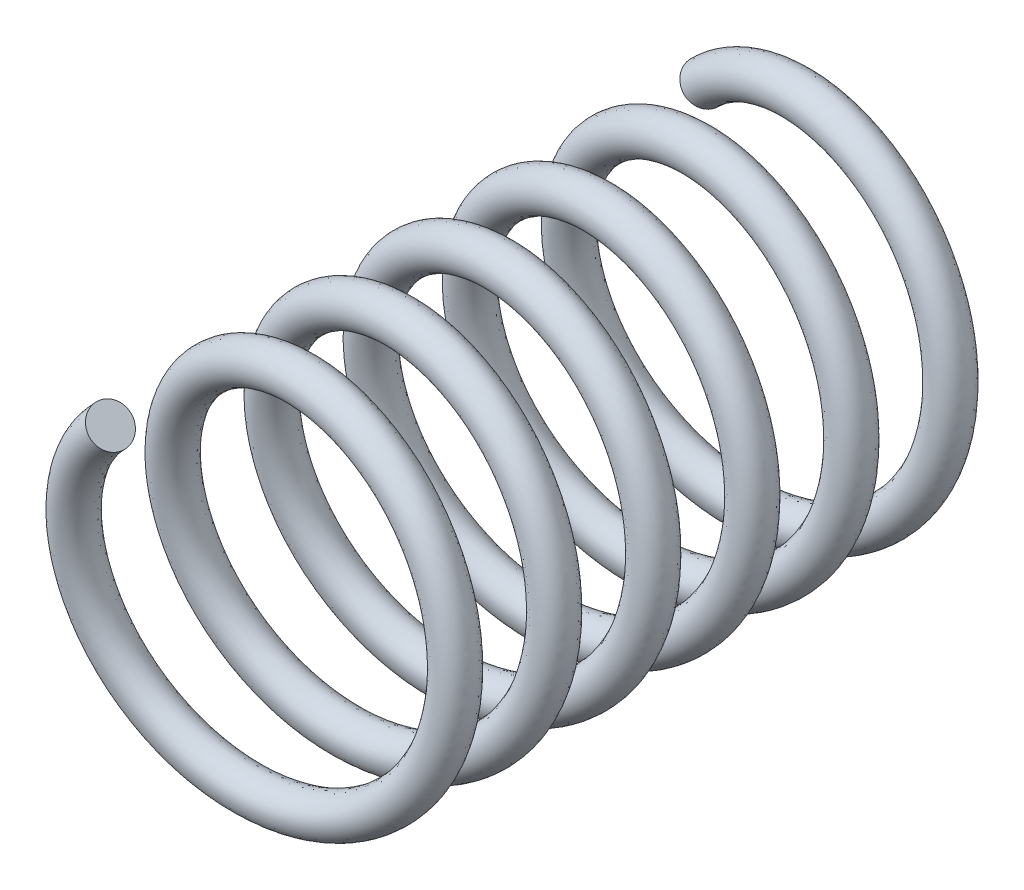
ISO-10303-21;
HEADER;
FILE_DESCRIPTION(('STEP AP214'),'2;1');
FILE_NAME('part.step','',(''),(''),'','','');
FILE_SCHEMA(('AUTOMOTIVE_DESIGN { 1 0 10303 214 1 1 1 1 }'));
ENDSEC;
DATA;
#1=APPLICATION_CONTEXT('core data for automotive mechanical design processes');
#2=APPLICATION_PROTOCOL_DEFINITION('international standard','automotive_design',2000,#1);
#3=PRODUCT_CONTEXT('',#1,'mechanical');
#4=PRODUCT('Part','Part','',(#3));
#5=PRODUCT_RELATED_PRODUCT_CATEGORY('part','',(#4));
#6=PRODUCT_DEFINITION_FORMATION('','',#4);
#7=PRODUCT_DEFINITION_CONTEXT('part definition',#1,'design');
#8=PRODUCT_DEFINITION('design','',#6,#7);
#9=PRODUCT_DEFINITION_SHAPE('','',#8);
#10=(LENGTH_UNIT() NAMED_UNIT(*) SI_UNIT(.MILLI.,.METRE.));
#11=(NAMED_UNIT(*) PLANE_ANGLE_UNIT() SI_UNIT($,.RADIAN.));
#12=(NAMED_UNIT(*) SI_UNIT($,.STERADIAN.) SOLID_ANGLE_UNIT());
#13=UNCERTAINTY_MEASURE_WITH_UNIT(LENGTH_MEASURE(1.E-05),#10,'distance_accuracy_value','');
#14=(GEOMETRIC_REPRESENTATION_CONTEXT(3) GLOBAL_UNCERTAINTY_ASSIGNED_CONTEXT((#13)) GLOBAL_UNIT_ASSIGNED_CONTEXT((#10,
#11,#12)) REPRESENTATION_CONTEXT('',''));
#15=CARTESIAN_POINT('',(0.,0.,0.));
#16=DIRECTION('',(0.,0.,1.));
#17=DIRECTION('',(1.,0.,0.));
#18=AXIS2_PLACEMENT_3D('',#15,#16,#17);
#19=CARTESIAN_POINT('',(-35.7513862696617,35.785287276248,181.743224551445));
#20=DIRECTION('',(0.704045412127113,0.704045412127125,0.092952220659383));
#21=DIRECTION('',(-0.707106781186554,0.707106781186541,0.));
#22=AXIS2_PLACEMENT_3D('',#19,#20,#21);
#23=PLANE('',#22);
#24=CARTESIAN_POINT('',(-35.7513862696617,35.785287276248,181.743224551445));
#25=DIRECTION('',(0.704045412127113,0.704045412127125,0.092952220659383));
#26=DIRECTION('',(-0.707106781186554,0.707106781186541,0.));
#27=AXIS2_PLACEMENT_3D('',#24,#25,#26);
#28=CIRCLE('',#27,6.);
#29=CARTESIAN_POINT('',(-39.994026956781,40.0279279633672,181.743224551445));
#30=VERTEX_POINT('',#29);
#31=EDGE_CURVE('E37',#30,#30,#28,.T.);
#32=ORIENTED_EDGE('',*,*,#31,.T.);
#33=EDGE_LOOP('',(#32));
#34=FACE_BOUND('',#33,.T.);
#35=ADVANCED_FACE('F30',(#34),#23,.T.);
#36=CARTESIAN_POINT('',(-35.7513862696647,35.785287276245,-0.256775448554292));
#37=DIRECTION('',(0.704045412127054,0.704045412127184,0.092952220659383));
#38=DIRECTION('',(-0.707106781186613,0.707106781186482,0.));
#39=AXIS2_PLACEMENT_3D('',#36,#37,#38);
#40=PLANE('',#39);
#41=CARTESIAN_POINT('',(-35.7513862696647,35.785287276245,-0.256775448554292));
#42=DIRECTION('',(0.704045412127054,0.704045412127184,0.092952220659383));
#43=DIRECTION('',(-0.707106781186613,0.707106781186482,0.));
#44=AXIS2_PLACEMENT_3D('',#41,#42,#43);
#45=CIRCLE('',#44,6.);
#46=CARTESIAN_POINT('',(-39.9940269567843,40.0279279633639,-0.256775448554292));
#47=VERTEX_POINT('',#46);
#48=EDGE_CURVE('E11',#47,#47,#45,.T.);
#49=ORIENTED_EDGE('',*,*,#48,.F.);
#50=EDGE_LOOP('',(#49));
#51=FACE_BOUND('',#50,.T.);
#52=ADVANCED_FACE('F46',(#51),#40,.F.);
#53=CARTESIAN_POINT('',(-39.994026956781,40.0279279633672,181.743224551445));
#54=CARTESIAN_POINT('',(-52.9998891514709,27.0330808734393,180.226557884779));
#55=CARTESIAN_POINT('',(-55.8836732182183,8.87537474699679,178.709891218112));
#56=CARTESIAN_POINT('',(-58.7674572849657,-9.2823313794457,177.193224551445));
#57=CARTESIAN_POINT('',(-50.4276557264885,-25.6672699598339,175.676557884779));
#58=CARTESIAN_POINT('',(-42.0878541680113,-42.0522085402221,174.159891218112));
#59=CARTESIAN_POINT('',(-25.7099877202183,-50.4058899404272,172.643224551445));
#60=CARTESIAN_POINT('',(-9.3321212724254,-58.7595713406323,171.126557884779));
#61=CARTESIAN_POINT('',(8.82802174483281,-55.8911731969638,169.609891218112));
#62=CARTESIAN_POINT('',(26.988164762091,-53.0227750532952,168.093224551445));
#63=CARTESIAN_POINT('',(39.994026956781,-40.0279279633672,166.576557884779));
#64=CARTESIAN_POINT('',(52.9998891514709,-27.0330808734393,165.059891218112));
#65=CARTESIAN_POINT('',(55.8836732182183,-8.87537474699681,163.543224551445));
#66=CARTESIAN_POINT('',(58.7674572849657,9.2823313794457,162.026557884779));
#67=CARTESIAN_POINT('',(50.4276557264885,25.6672699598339,160.509891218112));
#68=CARTESIAN_POINT('',(42.0878541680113,42.0522085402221,158.993224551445));
#69=CARTESIAN_POINT('',(25.7099877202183,50.4058899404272,157.476557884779));
#70=CARTESIAN_POINT('',(9.33212127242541,58.7595713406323,155.959891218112));
#71=CARTESIAN_POINT('',(-8.82802174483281,55.8911731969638,154.443224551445));
#72=CARTESIAN_POINT('',(-26.988164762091,53.0227750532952,152.926557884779));
#73=CARTESIAN_POINT('',(-39.994026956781,40.0279279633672,151.409891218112));
#74=CARTESIAN_POINT('',(-52.9998891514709,27.0330808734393,149.893224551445));
#75=CARTESIAN_POINT('',(-55.8836732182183,8.87537474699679,148.376557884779));
#76=CARTESIAN_POINT('',(-58.7674572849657,-9.2823313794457,146.859891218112));
#77=CARTESIAN_POINT('',(-50.4276557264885,-25.6672699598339,145.343224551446));
#78=CARTESIAN_POINT('',(-42.0878541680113,-42.0522085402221,143.826557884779));
#79=CARTESIAN_POINT('',(-25.7099877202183,-50.4058899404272,142.309891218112));
#80=CARTESIAN_POINT('',(-9.3321212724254,-58.7595713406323,140.793224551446));
#81=CARTESIAN_POINT('',(8.82802174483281,-55.8911731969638,139.276557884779));
#82=CARTESIAN_POINT('',(26.988164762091,-53.0227750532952,137.759891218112));
#83=CARTESIAN_POINT('',(39.994026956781,-40.0279279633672,136.243224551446));
#84=CARTESIAN_POINT('',(52.9998891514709,-27.0330808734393,134.726557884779));
#85=CARTESIAN_POINT('',(55.8836732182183,-8.87537474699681,133.209891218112));
#86=CARTESIAN_POINT('',(58.7674572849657,9.2823313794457,131.693224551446));
#87=CARTESIAN_POINT('',(50.4276557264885,25.6672699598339,130.176557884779));
#88=CARTESIAN_POINT('',(42.0878541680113,42.0522085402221,128.659891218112));
#89=CARTESIAN_POINT('',(25.7099877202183,50.4058899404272,127.143224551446));
#90=CARTESIAN_POINT('',(9.33212127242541,58.7595713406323,125.626557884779));
#91=CARTESIAN_POINT('',(-8.82802174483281,55.8911731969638,124.109891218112));
#92=CARTESIAN_POINT('',(-26.988164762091,53.0227750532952,122.593224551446));
#93=CARTESIAN_POINT('',(-39.994026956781,40.0279279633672,121.076557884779));
#94=CARTESIAN_POINT('',(-52.9998891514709,27.0330808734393,119.559891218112));
#95=CARTESIAN_POINT('',(-55.8836732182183,8.87537474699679,118.043224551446));
#96=CARTESIAN_POINT('',(-58.7674572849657,-9.2823313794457,116.526557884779));
#97=CARTESIAN_POINT('',(-50.4276557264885,-25.6672699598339,115.009891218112));
#98=CARTESIAN_POINT('',(-42.0878541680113,-42.0522085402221,113.493224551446));
#99=CARTESIAN_POINT('',(-25.7099877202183,-50.4058899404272,111.976557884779));
#100=CARTESIAN_POINT('',(-9.3321212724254,-58.7595713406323,110.459891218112));
#101=CARTESIAN_POINT('',(8.82802174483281,-55.8911731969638,108.943224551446));
#102=CARTESIAN_POINT('',(26.988164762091,-53.0227750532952,107.426557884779));
#103=CARTESIAN_POINT('',(39.994026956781,-40.0279279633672,105.909891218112));
#104=CARTESIAN_POINT('',(52.9998891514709,-27.0330808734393,104.393224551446));
#105=CARTESIAN_POINT('',(55.8836732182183,-8.87537474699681,102.876557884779));
#106=CARTESIAN_POINT('',(58.7674572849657,9.2823313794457,101.359891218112));
#107=CARTESIAN_POINT('',(50.4276557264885,25.6672699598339,99.8432245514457));
#108=CARTESIAN_POINT('',(42.0878541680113,42.0522085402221,98.326557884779));
#109=CARTESIAN_POINT('',(25.7099877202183,50.4058899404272,96.8098912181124));
#110=CARTESIAN_POINT('',(9.33212127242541,58.7595713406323,95.2932245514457));
#111=CARTESIAN_POINT('',(-8.82802174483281,55.8911731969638,93.776557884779));
#112=CARTESIAN_POINT('',(-26.988164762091,53.0227750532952,92.2598912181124));
#113=CARTESIAN_POINT('',(-39.994026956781,40.0279279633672,90.7432245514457));
#114=CARTESIAN_POINT('',(-52.9998891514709,27.0330808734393,89.2265578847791));
#115=CARTESIAN_POINT('',(-55.8836732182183,8.87537474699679,87.7098912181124));
#116=CARTESIAN_POINT('',(-58.7674572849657,-9.2823313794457,86.1932245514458));
#117=CARTESIAN_POINT('',(-50.4276557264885,-25.6672699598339,84.6765578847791));
#118=CARTESIAN_POINT('',(-42.0878541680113,-42.0522085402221,83.1598912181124));
#119=CARTESIAN_POINT('',(-25.7099877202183,-50.4058899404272,81.6432245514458));
#120=CARTESIAN_POINT('',(-9.3321212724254,-58.7595713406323,80.1265578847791));
#121=CARTESIAN_POINT('',(8.82802174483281,-55.8911731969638,78.6098912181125));
#122=CARTESIAN_POINT('',(26.988164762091,-53.0227750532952,77.0932245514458));
#123=CARTESIAN_POINT('',(39.994026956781,-40.0279279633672,75.5765578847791));
#124=CARTESIAN_POINT('',(52.9998891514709,-27.0330808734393,74.0598912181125));
#125=CARTESIAN_POINT('',(55.8836732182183,-8.87537474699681,72.5432245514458));
#126=CARTESIAN_POINT('',(58.7674572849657,9.2823313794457,71.0265578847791));
#127=CARTESIAN_POINT('',(50.4276557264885,25.6672699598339,69.5098912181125));
#128=CARTESIAN_POINT('',(42.0878541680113,42.0522085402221,67.9932245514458));
#129=CARTESIAN_POINT('',(25.7099877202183,50.4058899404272,66.4765578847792));
#130=CARTESIAN_POINT('',(9.33212127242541,58.7595713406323,64.9598912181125));
#131=CARTESIAN_POINT('',(-8.82802174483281,55.8911731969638,63.4432245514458));
#132=CARTESIAN_POINT('',(-26.988164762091,53.0227750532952,61.9265578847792));
#133=CARTESIAN_POINT('',(-39.994026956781,40.0279279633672,60.4098912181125));
#134=CARTESIAN_POINT('',(-52.9998891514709,27.0330808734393,58.8932245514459));
#135=CARTESIAN_POINT('',(-55.8836732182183,8.87537474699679,57.3765578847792));
#136=CARTESIAN_POINT('',(-58.7674572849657,-9.2823313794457,55.8598912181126));
#137=CARTESIAN_POINT('',(-50.4276557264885,-25.6672699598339,54.3432245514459));
#138=CARTESIAN_POINT('',(-42.0878541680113,-42.0522085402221,52.8265578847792));
#139=CARTESIAN_POINT('',(-25.7099877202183,-50.4058899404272,51.3098912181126));
#140=CARTESIAN_POINT('',(-9.3321212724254,-58.7595713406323,49.7932245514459));
#141=CARTESIAN_POINT('',(8.82802174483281,-55.8911731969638,48.2765578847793));
#142=CARTESIAN_POINT('',(26.988164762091,-53.0227750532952,46.7598912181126));
#143=CARTESIAN_POINT('',(39.994026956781,-40.0279279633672,45.2432245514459));
#144=CARTESIAN_POINT('',(52.9998891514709,-27.0330808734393,43.7265578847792));
#145=CARTESIAN_POINT('',(55.8836732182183,-8.87537474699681,42.2098912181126));
#146=CARTESIAN_POINT('',(58.7674572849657,9.2823313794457,40.6932245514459));
#147=CARTESIAN_POINT('',(50.4276557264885,25.6672699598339,39.1765578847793));
#148=CARTESIAN_POINT('',(42.0878541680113,42.0522085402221,37.6598912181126));
#149=CARTESIAN_POINT('',(25.7099877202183,50.4058899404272,36.1432245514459));
#150=CARTESIAN_POINT('',(9.33212127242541,58.7595713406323,34.6265578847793));
#151=CARTESIAN_POINT('',(-8.82802174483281,55.8911731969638,33.1098912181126));
#152=CARTESIAN_POINT('',(-26.988164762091,53.0227750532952,31.593224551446));
#153=CARTESIAN_POINT('',(-39.994026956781,40.0279279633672,30.0765578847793));
#154=CARTESIAN_POINT('',(-52.9998891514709,27.0330808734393,28.5598912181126));
#155=CARTESIAN_POINT('',(-55.8836732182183,8.87537474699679,27.043224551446));
#156=CARTESIAN_POINT('',(-58.7674572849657,-9.2823313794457,25.5265578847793));
#157=CARTESIAN_POINT('',(-50.4276557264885,-25.6672699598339,24.0098912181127));
#158=CARTESIAN_POINT('',(-42.0878541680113,-42.0522085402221,22.493224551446));
#159=CARTESIAN_POINT('',(-25.7099877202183,-50.4058899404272,20.9765578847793));
#160=CARTESIAN_POINT('',(-9.3321212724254,-58.7595713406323,19.4598912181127));
#161=CARTESIAN_POINT('',(8.82802174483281,-55.8911731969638,17.943224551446));
#162=CARTESIAN_POINT('',(26.988164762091,-53.0227750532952,16.4265578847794));
#163=CARTESIAN_POINT('',(39.994026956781,-40.0279279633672,14.9098912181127));
#164=CARTESIAN_POINT('',(52.9998891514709,-27.0330808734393,13.393224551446));
#165=CARTESIAN_POINT('',(55.8836732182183,-8.87537474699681,11.8765578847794));
#166=CARTESIAN_POINT('',(58.7674572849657,9.2823313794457,10.3598912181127));
#167=CARTESIAN_POINT('',(50.4276557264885,25.6672699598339,8.84322455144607));
#168=CARTESIAN_POINT('',(42.0878541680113,42.0522085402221,7.3265578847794));
#169=CARTESIAN_POINT('',(25.7099877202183,50.4058899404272,5.80989121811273));
#170=CARTESIAN_POINT('',(9.33212127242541,58.7595713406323,4.2932245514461));
#171=CARTESIAN_POINT('',(-8.82802174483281,55.8911731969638,2.77655788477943));
#172=CARTESIAN_POINT('',(-26.988164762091,53.0227750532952,1.25989121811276));
#173=CARTESIAN_POINT('',(-39.994026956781,40.0279279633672,-0.256775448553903));
#174=CARTESIAN_POINT('',(-40.7827527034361,39.2392022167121,193.691271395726));
#175=CARTESIAN_POINT('',(-53.5323423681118,25.9880825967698,192.174604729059));
#176=CARTESIAN_POINT('',(-56.0581643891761,7.77368085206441,190.657938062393));
#177=CARTESIAN_POINT('',(-58.5839864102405,-10.440720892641,189.141271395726));
#178=CARTESIAN_POINT('',(-49.9212626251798,-26.6611223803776,187.624604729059));
#179=CARTESIAN_POINT('',(-41.2585388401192,-42.8815238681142,186.107938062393));
#180=CARTESIAN_POINT('',(-24.7161352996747,-50.9122830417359,184.591271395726));
#181=CARTESIAN_POINT('',(-8.17373175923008,-58.9430422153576,183.074604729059));
#182=CARTESIAN_POINT('',(9.92971563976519,-55.7166820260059,181.557938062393));
#183=CARTESIAN_POINT('',(28.0331630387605,-52.4903218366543,180.041271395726));
#184=CARTESIAN_POINT('',(40.7827527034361,-39.2392022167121,178.524604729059));
#185=CARTESIAN_POINT('',(53.5323423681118,-25.9880825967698,177.007938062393));
#186=CARTESIAN_POINT('',(56.0581643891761,-7.77368085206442,175.491271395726));
#187=CARTESIAN_POINT('',(58.5839864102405,10.440720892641,173.974604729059));
#188=CARTESIAN_POINT('',(49.9212626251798,26.6611223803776,172.457938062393));
#189=CARTESIAN_POINT('',(41.2585388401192,42.8815238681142,170.941271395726));
#190=CARTESIAN_POINT('',(24.7161352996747,50.9122830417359,169.424604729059));
#191=CARTESIAN_POINT('',(8.17373175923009,58.9430422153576,167.907938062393));
#192=CARTESIAN_POINT('',(-9.92971563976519,55.7166820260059,166.391271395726));
#193=CARTESIAN_POINT('',(-28.0331630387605,52.4903218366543,164.874604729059));
#194=CARTESIAN_POINT('',(-40.7827527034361,39.2392022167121,163.357938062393));
#195=CARTESIAN_POINT('',(-53.5323423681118,25.9880825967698,161.841271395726));
#196=CARTESIAN_POINT('',(-56.0581643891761,7.77368085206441,160.32460472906));
#197=CARTESIAN_POINT('',(-58.5839864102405,-10.440720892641,158.807938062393));
#198=CARTESIAN_POINT('',(-49.9212626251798,-26.6611223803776,157.291271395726));
#199=CARTESIAN_POINT('',(-41.2585388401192,-42.8815238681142,155.77460472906));
#200=CARTESIAN_POINT('',(-24.7161352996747,-50.9122830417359,154.257938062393));
#201=CARTESIAN_POINT('',(-8.17373175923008,-58.9430422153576,152.741271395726));
#202=CARTESIAN_POINT('',(9.92971563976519,-55.7166820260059,151.22460472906));
#203=CARTESIAN_POINT('',(28.0331630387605,-52.4903218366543,149.707938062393));
#204=CARTESIAN_POINT('',(40.7827527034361,-39.2392022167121,148.191271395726));
#205=CARTESIAN_POINT('',(53.5323423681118,-25.9880825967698,146.67460472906));
#206=CARTESIAN_POINT('',(56.0581643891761,-7.77368085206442,145.157938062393));
#207=CARTESIAN_POINT('',(58.5839864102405,10.440720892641,143.641271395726));
#208=CARTESIAN_POINT('',(49.9212626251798,26.6611223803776,142.12460472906));
#209=CARTESIAN_POINT('',(41.2585388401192,42.8815238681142,140.607938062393));
#210=CARTESIAN_POINT('',(24.7161352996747,50.9122830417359,139.091271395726));
#211=CARTESIAN_POINT('',(8.17373175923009,58.9430422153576,137.57460472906));
#212=CARTESIAN_POINT('',(-9.92971563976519,55.7166820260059,136.057938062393));
#213=CARTESIAN_POINT('',(-28.0331630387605,52.4903218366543,134.541271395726));
#214=CARTESIAN_POINT('',(-40.7827527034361,39.2392022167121,133.02460472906));
#215=CARTESIAN_POINT('',(-53.5323423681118,25.9880825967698,131.507938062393));
#216=CARTESIAN_POINT('',(-56.0581643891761,7.77368085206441,129.991271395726));
#217=CARTESIAN_POINT('',(-58.5839864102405,-10.440720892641,128.47460472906));
#218=CARTESIAN_POINT('',(-49.9212626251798,-26.6611223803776,126.957938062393));
#219=CARTESIAN_POINT('',(-41.2585388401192,-42.8815238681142,125.441271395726));
#220=CARTESIAN_POINT('',(-24.7161352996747,-50.9122830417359,123.92460472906));
#221=CARTESIAN_POINT('',(-8.17373175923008,-58.9430422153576,122.407938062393));
#222=CARTESIAN_POINT('',(9.92971563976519,-55.7166820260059,120.891271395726));
#223=CARTESIAN_POINT('',(28.0331630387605,-52.4903218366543,119.37460472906));
#224=CARTESIAN_POINT('',(40.7827527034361,-39.2392022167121,117.857938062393));
#225=CARTESIAN_POINT('',(53.5323423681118,-25.9880825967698,116.341271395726));
#226=CARTESIAN_POINT('',(56.0581643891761,-7.77368085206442,114.82460472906));
#227=CARTESIAN_POINT('',(58.5839864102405,10.440720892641,113.307938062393));
#228=CARTESIAN_POINT('',(49.9212626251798,26.6611223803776,111.791271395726));
#229=CARTESIAN_POINT('',(41.2585388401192,42.8815238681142,110.27460472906));
#230=CARTESIAN_POINT('',(24.7161352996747,50.9122830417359,108.757938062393));
#231=CARTESIAN_POINT('',(8.17373175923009,58.9430422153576,107.241271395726));
#232=CARTESIAN_POINT('',(-9.92971563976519,55.7166820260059,105.72460472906));
#233=CARTESIAN_POINT('',(-28.0331630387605,52.4903218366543,104.207938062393));
#234=CARTESIAN_POINT('',(-40.7827527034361,39.2392022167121,102.691271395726));
#235=CARTESIAN_POINT('',(-53.5323423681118,25.9880825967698,101.17460472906));
#236=CARTESIAN_POINT('',(-56.0581643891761,7.77368085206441,99.6579380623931));
#237=CARTESIAN_POINT('',(-58.5839864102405,-10.440720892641,98.1412713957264));
#238=CARTESIAN_POINT('',(-49.9212626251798,-26.6611223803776,96.6246047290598));
#239=CARTESIAN_POINT('',(-41.2585388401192,-42.8815238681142,95.1079380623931));
#240=CARTESIAN_POINT('',(-24.7161352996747,-50.9122830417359,93.5912713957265));
#241=CARTESIAN_POINT('',(-8.17373175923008,-58.9430422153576,92.0746047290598));
#242=CARTESIAN_POINT('',(9.92971563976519,-55.7166820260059,90.5579380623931));
#243=CARTESIAN_POINT('',(28.0331630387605,-52.4903218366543,89.0412713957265));
#244=CARTESIAN_POINT('',(40.7827527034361,-39.2392022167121,87.5246047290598));
#245=CARTESIAN_POINT('',(53.5323423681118,-25.9880825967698,86.0079380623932));
#246=CARTESIAN_POINT('',(56.0581643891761,-7.77368085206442,84.4912713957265));
#247=CARTESIAN_POINT('',(58.5839864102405,10.440720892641,82.9746047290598));
#248=CARTESIAN_POINT('',(49.9212626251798,26.6611223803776,81.4579380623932));
#249=CARTESIAN_POINT('',(41.2585388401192,42.8815238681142,79.9412713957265));
#250=CARTESIAN_POINT('',(24.7161352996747,50.9122830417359,78.4246047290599));
#251=CARTESIAN_POINT('',(8.17373175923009,58.9430422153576,76.9079380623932));
#252=CARTESIAN_POINT('',(-9.92971563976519,55.7166820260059,75.3912713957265));
#253=CARTESIAN_POINT('',(-28.0331630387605,52.4903218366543,73.8746047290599));
#254=CARTESIAN_POINT('',(-40.7827527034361,39.2392022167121,72.3579380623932));
#255=CARTESIAN_POINT('',(-53.5323423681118,25.9880825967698,70.8412713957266));
#256=CARTESIAN_POINT('',(-56.0581643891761,7.77368085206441,69.3246047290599));
#257=CARTESIAN_POINT('',(-58.5839864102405,-10.440720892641,67.8079380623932));
#258=CARTESIAN_POINT('',(-49.9212626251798,-26.6611223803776,66.2912713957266));
#259=CARTESIAN_POINT('',(-41.2585388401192,-42.8815238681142,64.7746047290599));
#260=CARTESIAN_POINT('',(-24.7161352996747,-50.9122830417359,63.2579380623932));
#261=CARTESIAN_POINT('',(-8.17373175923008,-58.9430422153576,61.7412713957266));
#262=CARTESIAN_POINT('',(9.92971563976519,-55.7166820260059,60.2246047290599));
#263=CARTESIAN_POINT('',(28.0331630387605,-52.4903218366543,58.7079380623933));
#264=CARTESIAN_POINT('',(40.7827527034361,-39.2392022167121,57.1912713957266));
#265=CARTESIAN_POINT('',(53.5323423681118,-25.9880825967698,55.6746047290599));
#266=CARTESIAN_POINT('',(56.0581643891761,-7.77368085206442,54.1579380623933));
#267=CARTESIAN_POINT('',(58.5839864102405,10.440720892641,52.6412713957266));
#268=CARTESIAN_POINT('',(49.9212626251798,26.6611223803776,51.12460472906));
#269=CARTESIAN_POINT('',(41.2585388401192,42.8815238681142,49.6079380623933));
#270=CARTESIAN_POINT('',(24.7161352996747,50.9122830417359,48.0912713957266));
#271=CARTESIAN_POINT('',(8.17373175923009,58.9430422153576,46.57460472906));
#272=CARTESIAN_POINT('',(-9.92971563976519,55.7166820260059,45.0579380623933));
#273=CARTESIAN_POINT('',(-28.0331630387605,52.4903218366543,43.5412713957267));
#274=CARTESIAN_POINT('',(-40.7827527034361,39.2392022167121,42.02460472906));
#275=CARTESIAN_POINT('',(-53.5323423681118,25.9880825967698,40.5079380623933));
#276=CARTESIAN_POINT('',(-56.0581643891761,7.77368085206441,38.9912713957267));
#277=CARTESIAN_POINT('',(-58.5839864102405,-10.440720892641,37.47460472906));
#278=CARTESIAN_POINT('',(-49.9212626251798,-26.6611223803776,35.9579380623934));
#279=CARTESIAN_POINT('',(-41.2585388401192,-42.8815238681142,34.4412713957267));
#280=CARTESIAN_POINT('',(-24.7161352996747,-50.9122830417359,32.92460472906));
#281=CARTESIAN_POINT('',(-8.17373175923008,-58.9430422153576,31.4079380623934));
#282=CARTESIAN_POINT('',(9.92971563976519,-55.7166820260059,29.8912713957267));
#283=CARTESIAN_POINT('',(28.0331630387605,-52.4903218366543,28.3746047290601));
#284=CARTESIAN_POINT('',(40.7827527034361,-39.2392022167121,26.8579380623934));
#285=CARTESIAN_POINT('',(53.5323423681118,-25.9880825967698,25.3412713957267));
#286=CARTESIAN_POINT('',(56.0581643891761,-7.77368085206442,23.8246047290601));
#287=CARTESIAN_POINT('',(58.5839864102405,10.440720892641,22.3079380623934));
#288=CARTESIAN_POINT('',(49.9212626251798,26.6611223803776,20.7912713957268));
#289=CARTESIAN_POINT('',(41.2585388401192,42.8815238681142,19.2746047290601));
#290=CARTESIAN_POINT('',(24.7161352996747,50.9122830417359,17.7579380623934));
#291=CARTESIAN_POINT('',(8.17373175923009,58.9430422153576,16.2412713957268));
#292=CARTESIAN_POINT('',(-9.92971563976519,55.7166820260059,14.7246047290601));
#293=CARTESIAN_POINT('',(-28.0331630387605,52.4903218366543,13.2079380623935));
#294=CARTESIAN_POINT('',(-40.7827527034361,39.2392022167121,11.6912713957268));
#295=CARTESIAN_POINT('',(-32.2974713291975,30.7539208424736,193.691271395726));
#296=CARTESIAN_POINT('',(-42.2900259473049,20.2598362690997,192.174604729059));
#297=CARTESIAN_POINT('',(-44.2059043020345,5.89646727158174,190.657938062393));
#298=CARTESIAN_POINT('',(-46.1217826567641,-8.46690172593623,189.141271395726));
#299=CARTESIAN_POINT('',(-39.2291843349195,-21.213236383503,187.624604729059));
#300=CARTESIAN_POINT('',(-32.3365860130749,-33.9595710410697,186.107938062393));
#301=CARTESIAN_POINT('',(-19.2682493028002,-40.2202047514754,184.591271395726));
#302=CARTESIAN_POINT('',(-6.19991259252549,-46.4808384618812,183.074604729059));
#303=CARTESIAN_POINT('',(8.05250205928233,-43.8644219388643,181.557938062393));
#304=CARTESIAN_POINT('',(22.3049167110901,-41.2480054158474,180.041271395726));
#305=CARTESIAN_POINT('',(32.2974713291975,-30.7539208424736,178.524604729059));
#306=CARTESIAN_POINT('',(42.2900259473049,-20.2598362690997,177.007938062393));
#307=CARTESIAN_POINT('',(44.2059043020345,-5.89646727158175,175.491271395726));
#308=CARTESIAN_POINT('',(46.1217826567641,8.46690172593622,173.974604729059));
#309=CARTESIAN_POINT('',(39.2291843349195,21.2132363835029,172.457938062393));
#310=CARTESIAN_POINT('',(32.3365860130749,33.9595710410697,170.941271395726));
#311=CARTESIAN_POINT('',(19.2682493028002,40.2202047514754,169.424604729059));
#312=CARTESIAN_POINT('',(6.1999125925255,46.4808384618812,167.907938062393));
#313=CARTESIAN_POINT('',(-8.05250205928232,43.8644219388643,166.391271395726));
#314=CARTESIAN_POINT('',(-22.3049167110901,41.2480054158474,164.874604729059));
#315=CARTESIAN_POINT('',(-32.2974713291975,30.7539208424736,163.357938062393));
#316=CARTESIAN_POINT('',(-42.2900259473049,20.2598362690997,161.841271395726));
#317=CARTESIAN_POINT('',(-44.2059043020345,5.89646727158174,160.32460472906));
#318=CARTESIAN_POINT('',(-46.1217826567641,-8.46690172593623,158.807938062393));
#319=CARTESIAN_POINT('',(-39.2291843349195,-21.213236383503,157.291271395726));
#320=CARTESIAN_POINT('',(-32.3365860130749,-33.9595710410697,155.77460472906));
#321=CARTESIAN_POINT('',(-19.2682493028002,-40.2202047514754,154.257938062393));
#322=CARTESIAN_POINT('',(-6.19991259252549,-46.4808384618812,152.741271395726));
#323=CARTESIAN_POINT('',(8.05250205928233,-43.8644219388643,151.22460472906));
#324=CARTESIAN_POINT('',(22.3049167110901,-41.2480054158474,149.707938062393));
#325=CARTESIAN_POINT('',(32.2974713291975,-30.7539208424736,148.191271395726));
#326=CARTESIAN_POINT('',(42.2900259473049,-20.2598362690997,146.67460472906));
#327=CARTESIAN_POINT('',(44.2059043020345,-5.89646727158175,145.157938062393));
#328=CARTESIAN_POINT('',(46.1217826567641,8.46690172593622,143.641271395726));
#329=CARTESIAN_POINT('',(39.2291843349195,21.2132363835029,142.12460472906));
#330=CARTESIAN_POINT('',(32.3365860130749,33.9595710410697,140.607938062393));
#331=CARTESIAN_POINT('',(19.2682493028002,40.2202047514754,139.091271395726));
#332=CARTESIAN_POINT('',(6.1999125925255,46.4808384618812,137.57460472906));
#333=CARTESIAN_POINT('',(-8.05250205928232,43.8644219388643,136.057938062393));
#334=CARTESIAN_POINT('',(-22.3049167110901,41.2480054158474,134.541271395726));
#335=CARTESIAN_POINT('',(-32.2974713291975,30.7539208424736,133.02460472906));
#336=CARTESIAN_POINT('',(-42.2900259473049,20.2598362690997,131.507938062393));
#337=CARTESIAN_POINT('',(-44.2059043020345,5.89646727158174,129.991271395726));
#338=CARTESIAN_POINT('',(-46.1217826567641,-8.46690172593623,128.47460472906));
#339=CARTESIAN_POINT('',(-39.2291843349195,-21.213236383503,126.957938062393));
#340=CARTESIAN_POINT('',(-32.3365860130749,-33.9595710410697,125.441271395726));
#341=CARTESIAN_POINT('',(-19.2682493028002,-40.2202047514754,123.92460472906));
#342=CARTESIAN_POINT('',(-6.19991259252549,-46.4808384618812,122.407938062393));
#343=CARTESIAN_POINT('',(8.05250205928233,-43.8644219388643,120.891271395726));
#344=CARTESIAN_POINT('',(22.3049167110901,-41.2480054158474,119.37460472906));
#345=CARTESIAN_POINT('',(32.2974713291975,-30.7539208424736,117.857938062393));
#346=CARTESIAN_POINT('',(42.2900259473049,-20.2598362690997,116.341271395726));
#347=CARTESIAN_POINT('',(44.2059043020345,-5.89646727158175,114.82460472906));
#348=CARTESIAN_POINT('',(46.1217826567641,8.46690172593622,113.307938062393));
#349=CARTESIAN_POINT('',(39.2291843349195,21.2132363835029,111.791271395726));
#350=CARTESIAN_POINT('',(32.3365860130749,33.9595710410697,110.27460472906));
#351=CARTESIAN_POINT('',(19.2682493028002,40.2202047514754,108.757938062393));
#352=CARTESIAN_POINT('',(6.1999125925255,46.4808384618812,107.241271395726));
#353=CARTESIAN_POINT('',(-8.05250205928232,43.8644219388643,105.72460472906));
#354=CARTESIAN_POINT('',(-22.3049167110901,41.2480054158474,104.207938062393));
#355=CARTESIAN_POINT('',(-32.2974713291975,30.7539208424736,102.691271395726));
#356=CARTESIAN_POINT('',(-42.2900259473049,20.2598362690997,101.17460472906));
#357=CARTESIAN_POINT('',(-44.2059043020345,5.89646727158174,99.6579380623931));
#358=CARTESIAN_POINT('',(-46.1217826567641,-8.46690172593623,98.1412713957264));
#359=CARTESIAN_POINT('',(-39.2291843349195,-21.213236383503,96.6246047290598));
#360=CARTESIAN_POINT('',(-32.3365860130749,-33.9595710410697,95.1079380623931));
#361=CARTESIAN_POINT('',(-19.2682493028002,-40.2202047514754,93.5912713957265));
#362=CARTESIAN_POINT('',(-6.19991259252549,-46.4808384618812,92.0746047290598));
#363=CARTESIAN_POINT('',(8.05250205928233,-43.8644219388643,90.5579380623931));
#364=CARTESIAN_POINT('',(22.3049167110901,-41.2480054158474,89.0412713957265));
#365=CARTESIAN_POINT('',(32.2974713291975,-30.7539208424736,87.5246047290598));
#366=CARTESIAN_POINT('',(42.2900259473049,-20.2598362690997,86.0079380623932));
#367=CARTESIAN_POINT('',(44.2059043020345,-5.89646727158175,84.4912713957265));
#368=CARTESIAN_POINT('',(46.1217826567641,8.46690172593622,82.9746047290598));
#369=CARTESIAN_POINT('',(39.2291843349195,21.2132363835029,81.4579380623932));
#370=CARTESIAN_POINT('',(32.3365860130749,33.9595710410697,79.9412713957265));
#371=CARTESIAN_POINT('',(19.2682493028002,40.2202047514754,78.4246047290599));
#372=CARTESIAN_POINT('',(6.1999125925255,46.4808384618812,76.9079380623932));
#373=CARTESIAN_POINT('',(-8.05250205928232,43.8644219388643,75.3912713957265));
#374=CARTESIAN_POINT('',(-22.3049167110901,41.2480054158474,73.8746047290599));
#375=CARTESIAN_POINT('',(-32.2974713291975,30.7539208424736,72.3579380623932));
#376=CARTESIAN_POINT('',(-42.2900259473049,20.2598362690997,70.8412713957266));
#377=CARTESIAN_POINT('',(-44.2059043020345,5.89646727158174,69.3246047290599));
#378=CARTESIAN_POINT('',(-46.1217826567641,-8.46690172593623,67.8079380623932));
#379=CARTESIAN_POINT('',(-39.2291843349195,-21.213236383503,66.2912713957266));
#380=CARTESIAN_POINT('',(-32.3365860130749,-33.9595710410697,64.7746047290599));
#381=CARTESIAN_POINT('',(-19.2682493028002,-40.2202047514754,63.2579380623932));
#382=CARTESIAN_POINT('',(-6.19991259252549,-46.4808384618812,61.7412713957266));
#383=CARTESIAN_POINT('',(8.05250205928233,-43.8644219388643,60.2246047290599));
#384=CARTESIAN_POINT('',(22.3049167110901,-41.2480054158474,58.7079380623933));
#385=CARTESIAN_POINT('',(32.2974713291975,-30.7539208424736,57.1912713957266));
#386=CARTESIAN_POINT('',(42.2900259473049,-20.2598362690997,55.6746047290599));
#387=CARTESIAN_POINT('',(44.2059043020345,-5.89646727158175,54.1579380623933));
#388=CARTESIAN_POINT('',(46.1217826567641,8.46690172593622,52.6412713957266));
#389=CARTESIAN_POINT('',(39.2291843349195,21.2132363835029,51.12460472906));
#390=CARTESIAN_POINT('',(32.3365860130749,33.9595710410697,49.6079380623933));
#391=CARTESIAN_POINT('',(19.2682493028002,40.2202047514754,48.0912713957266));
#392=CARTESIAN_POINT('',(6.1999125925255,46.4808384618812,46.57460472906));
#393=CARTESIAN_POINT('',(-8.05250205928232,43.8644219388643,45.0579380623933));
#394=CARTESIAN_POINT('',(-22.3049167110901,41.2480054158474,43.5412713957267));
#395=CARTESIAN_POINT('',(-32.2974713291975,30.7539208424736,42.02460472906));
#396=CARTESIAN_POINT('',(-42.2900259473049,20.2598362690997,40.5079380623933));
#397=CARTESIAN_POINT('',(-44.2059043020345,5.89646727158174,38.9912713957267));
#398=CARTESIAN_POINT('',(-46.1217826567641,-8.46690172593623,37.47460472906));
#399=CARTESIAN_POINT('',(-39.2291843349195,-21.213236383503,35.9579380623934));
#400=CARTESIAN_POINT('',(-32.3365860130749,-33.9595710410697,34.4412713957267));
#401=CARTESIAN_POINT('',(-19.2682493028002,-40.2202047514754,32.92460472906));
#402=CARTESIAN_POINT('',(-6.19991259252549,-46.4808384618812,31.4079380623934));
#403=CARTESIAN_POINT('',(8.05250205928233,-43.8644219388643,29.8912713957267));
#404=CARTESIAN_POINT('',(22.3049167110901,-41.2480054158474,28.3746047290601));
#405=CARTESIAN_POINT('',(32.2974713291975,-30.7539208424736,26.8579380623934));
#406=CARTESIAN_POINT('',(42.2900259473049,-20.2598362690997,25.3412713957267));
#407=CARTESIAN_POINT('',(44.2059043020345,-5.89646727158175,23.8246047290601));
#408=CARTESIAN_POINT('',(46.1217826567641,8.46690172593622,22.3079380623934));
#409=CARTESIAN_POINT('',(39.2291843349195,21.2132363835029,20.7912713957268));
#410=CARTESIAN_POINT('',(32.3365860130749,33.9595710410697,19.2746047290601));
#411=CARTESIAN_POINT('',(19.2682493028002,40.2202047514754,17.7579380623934));
#412=CARTESIAN_POINT('',(6.1999125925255,46.4808384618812,16.2412713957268));
#413=CARTESIAN_POINT('',(-8.05250205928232,43.8644219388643,14.7246047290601));
#414=CARTESIAN_POINT('',(-22.3049167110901,41.2480054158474,13.2079380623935));
#415=CARTESIAN_POINT('',(-32.2974713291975,30.7539208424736,11.6912713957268));
#416=CARTESIAN_POINT('',(-31.5087455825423,31.5426465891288,181.743224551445));
#417=CARTESIAN_POINT('',(-41.757572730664,21.3048345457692,180.226557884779));
#418=CARTESIAN_POINT('',(-44.0314131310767,6.99816116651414,178.709891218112));
#419=CARTESIAN_POINT('',(-46.3052535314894,-7.3085122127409,177.193224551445));
#420=CARTESIAN_POINT('',(-39.7355774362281,-20.2193839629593,175.676557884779));
#421=CARTESIAN_POINT('',(-33.1659013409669,-33.1302557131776,174.159891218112));
#422=CARTESIAN_POINT('',(-20.2621017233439,-39.7138116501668,172.643224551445));
#423=CARTESIAN_POINT('',(-7.35830210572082,-46.2973675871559,171.126557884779));
#424=CARTESIAN_POINT('',(6.95080816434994,-44.0389131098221,169.609891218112));
#425=CARTESIAN_POINT('',(21.2599184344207,-41.7804586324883,168.093224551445));
#426=CARTESIAN_POINT('',(31.5087455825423,-31.5426465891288,166.576557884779));
#427=CARTESIAN_POINT('',(41.757572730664,-21.3048345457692,165.059891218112));
#428=CARTESIAN_POINT('',(44.0314131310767,-6.99816116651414,163.543224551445));
#429=CARTESIAN_POINT('',(46.3052535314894,7.30851221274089,162.026557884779));
#430=CARTESIAN_POINT('',(39.7355774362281,20.2193839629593,160.509891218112));
#431=CARTESIAN_POINT('',(33.1659013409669,33.1302557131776,158.993224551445));
#432=CARTESIAN_POINT('',(20.2621017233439,39.7138116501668,157.476557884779));
#433=CARTESIAN_POINT('',(7.35830210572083,46.2973675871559,155.959891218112));
#434=CARTESIAN_POINT('',(-6.95080816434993,44.0389131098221,154.443224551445));
#435=CARTESIAN_POINT('',(-21.2599184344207,41.7804586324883,152.926557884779));
#436=CARTESIAN_POINT('',(-31.5087455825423,31.5426465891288,151.409891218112));
#437=CARTESIAN_POINT('',(-41.757572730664,21.3048345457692,149.893224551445));
#438=CARTESIAN_POINT('',(-44.0314131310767,6.99816116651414,148.376557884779));
#439=CARTESIAN_POINT('',(-46.3052535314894,-7.3085122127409,146.859891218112));
#440=CARTESIAN_POINT('',(-39.7355774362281,-20.2193839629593,145.343224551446));
#441=CARTESIAN_POINT('',(-33.1659013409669,-33.1302557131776,143.826557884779));
#442=CARTESIAN_POINT('',(-20.2621017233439,-39.7138116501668,142.309891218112));
#443=CARTESIAN_POINT('',(-7.35830210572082,-46.2973675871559,140.793224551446));
#444=CARTESIAN_POINT('',(6.95080816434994,-44.0389131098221,139.276557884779));
#445=CARTESIAN_POINT('',(21.2599184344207,-41.7804586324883,137.759891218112));
#446=CARTESIAN_POINT('',(31.5087455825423,-31.5426465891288,136.243224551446));
#447=CARTESIAN_POINT('',(41.757572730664,-21.3048345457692,134.726557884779));
#448=CARTESIAN_POINT('',(44.0314131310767,-6.99816116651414,133.209891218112));
#449=CARTESIAN_POINT('',(46.3052535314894,7.30851221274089,131.693224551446));
#450=CARTESIAN_POINT('',(39.7355774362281,20.2193839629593,130.176557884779));
#451=CARTESIAN_POINT('',(33.1659013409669,33.1302557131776,128.659891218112));
#452=CARTESIAN_POINT('',(20.2621017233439,39.7138116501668,127.143224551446));
#453=CARTESIAN_POINT('',(7.35830210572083,46.2973675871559,125.626557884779));
#454=CARTESIAN_POINT('',(-6.95080816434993,44.0389131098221,124.109891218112));
#455=CARTESIAN_POINT('',(-21.2599184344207,41.7804586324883,122.593224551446));
#456=CARTESIAN_POINT('',(-31.5087455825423,31.5426465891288,121.076557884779));
#457=CARTESIAN_POINT('',(-41.757572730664,21.3048345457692,119.559891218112));
#458=CARTESIAN_POINT('',(-44.0314131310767,6.99816116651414,118.043224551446));
#459=CARTESIAN_POINT('',(-46.3052535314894,-7.3085122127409,116.526557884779));
#460=CARTESIAN_POINT('',(-39.7355774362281,-20.2193839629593,115.009891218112));
#461=CARTESIAN_POINT('',(-33.1659013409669,-33.1302557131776,113.493224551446));
#462=CARTESIAN_POINT('',(-20.2621017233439,-39.7138116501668,111.976557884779));
#463=CARTESIAN_POINT('',(-7.35830210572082,-46.2973675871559,110.459891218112));
#464=CARTESIAN_POINT('',(6.95080816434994,-44.0389131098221,108.943224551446));
#465=CARTESIAN_POINT('',(21.2599184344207,-41.7804586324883,107.426557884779));
#466=CARTESIAN_POINT('',(31.5087455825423,-31.5426465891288,105.909891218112));
#467=CARTESIAN_POINT('',(41.757572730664,-21.3048345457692,104.393224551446));
#468=CARTESIAN_POINT('',(44.0314131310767,-6.99816116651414,102.876557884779));
#469=CARTESIAN_POINT('',(46.3052535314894,7.30851221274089,101.359891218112));
#470=CARTESIAN_POINT('',(39.7355774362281,20.2193839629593,99.8432245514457));
#471=CARTESIAN_POINT('',(33.1659013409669,33.1302557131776,98.326557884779));
#472=CARTESIAN_POINT('',(20.2621017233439,39.7138116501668,96.8098912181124));
#473=CARTESIAN_POINT('',(7.35830210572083,46.2973675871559,95.2932245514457));
#474=CARTESIAN_POINT('',(-6.95080816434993,44.0389131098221,93.776557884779));
#475=CARTESIAN_POINT('',(-21.2599184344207,41.7804586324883,92.2598912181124));
#476=CARTESIAN_POINT('',(-31.5087455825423,31.5426465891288,90.7432245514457));
#477=CARTESIAN_POINT('',(-41.757572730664,21.3048345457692,89.2265578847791));
#478=CARTESIAN_POINT('',(-44.0314131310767,6.99816116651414,87.7098912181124));
#479=CARTESIAN_POINT('',(-46.3052535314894,-7.3085122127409,86.1932245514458));
#480=CARTESIAN_POINT('',(-39.7355774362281,-20.2193839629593,84.6765578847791));
#481=CARTESIAN_POINT('',(-33.1659013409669,-33.1302557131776,83.1598912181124));
#482=CARTESIAN_POINT('',(-20.2621017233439,-39.7138116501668,81.6432245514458));
#483=CARTESIAN_POINT('',(-7.35830210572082,-46.2973675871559,80.1265578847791));
#484=CARTESIAN_POINT('',(6.95080816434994,-44.0389131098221,78.6098912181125));
#485=CARTESIAN_POINT('',(21.2599184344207,-41.7804586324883,77.0932245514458));
#486=CARTESIAN_POINT('',(31.5087455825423,-31.5426465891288,75.5765578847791));
#487=CARTESIAN_POINT('',(41.757572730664,-21.3048345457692,74.0598912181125));
#488=CARTESIAN_POINT('',(44.0314131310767,-6.99816116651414,72.5432245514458));
#489=CARTESIAN_POINT('',(46.3052535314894,7.30851221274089,71.0265578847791));
#490=CARTESIAN_POINT('',(39.7355774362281,20.2193839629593,69.5098912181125));
#491=CARTESIAN_POINT('',(33.1659013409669,33.1302557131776,67.9932245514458));
#492=CARTESIAN_POINT('',(20.2621017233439,39.7138116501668,66.4765578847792));
#493=CARTESIAN_POINT('',(7.35830210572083,46.2973675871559,64.9598912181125));
#494=CARTESIAN_POINT('',(-6.95080816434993,44.0389131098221,63.4432245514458));
#495=CARTESIAN_POINT('',(-21.2599184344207,41.7804586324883,61.9265578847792));
#496=CARTESIAN_POINT('',(-31.5087455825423,31.5426465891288,60.4098912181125));
#497=CARTESIAN_POINT('',(-41.757572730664,21.3048345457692,58.8932245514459));
#498=CARTESIAN_POINT('',(-44.0314131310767,6.99816116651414,57.3765578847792));
#499=CARTESIAN_POINT('',(-46.3052535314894,-7.3085122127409,55.8598912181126));
#500=CARTESIAN_POINT('',(-39.7355774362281,-20.2193839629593,54.3432245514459));
#501=CARTESIAN_POINT('',(-33.1659013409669,-33.1302557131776,52.8265578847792));
#502=CARTESIAN_POINT('',(-20.2621017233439,-39.7138116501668,51.3098912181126));
#503=CARTESIAN_POINT('',(-7.35830210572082,-46.2973675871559,49.7932245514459));
#504=CARTESIAN_POINT('',(6.95080816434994,-44.0389131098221,48.2765578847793));
#505=CARTESIAN_POINT('',(21.2599184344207,-41.7804586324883,46.7598912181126));
#506=CARTESIAN_POINT('',(31.5087455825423,-31.5426465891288,45.2432245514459));
#507=CARTESIAN_POINT('',(41.757572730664,-21.3048345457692,43.7265578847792));
#508=CARTESIAN_POINT('',(44.0314131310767,-6.99816116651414,42.2098912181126));
#509=CARTESIAN_POINT('',(46.3052535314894,7.30851221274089,40.6932245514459));
#510=CARTESIAN_POINT('',(39.7355774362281,20.2193839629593,39.1765578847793));
#511=CARTESIAN_POINT('',(33.1659013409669,33.1302557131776,37.6598912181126));
#512=CARTESIAN_POINT('',(20.2621017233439,39.7138116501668,36.1432245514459));
#513=CARTESIAN_POINT('',(7.35830210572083,46.2973675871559,34.6265578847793));
#514=CARTESIAN_POINT('',(-6.95080816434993,44.0389131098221,33.1098912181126));
#515=CARTESIAN_POINT('',(-21.2599184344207,41.7804586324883,31.593224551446));
#516=CARTESIAN_POINT('',(-31.5087455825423,31.5426465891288,30.0765578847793));
#517=CARTESIAN_POINT('',(-41.757572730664,21.3048345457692,28.5598912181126));
#518=CARTESIAN_POINT('',(-44.0314131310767,6.99816116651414,27.043224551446));
#519=CARTESIAN_POINT('',(-46.3052535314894,-7.3085122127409,25.5265578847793));
#520=CARTESIAN_POINT('',(-39.7355774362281,-20.2193839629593,24.0098912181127));
#521=CARTESIAN_POINT('',(-33.1659013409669,-33.1302557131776,22.493224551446));
#522=CARTESIAN_POINT('',(-20.2621017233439,-39.7138116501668,20.9765578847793));
#523=CARTESIAN_POINT('',(-7.35830210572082,-46.2973675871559,19.4598912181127));
#524=CARTESIAN_POINT('',(6.95080816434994,-44.0389131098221,17.943224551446));
#525=CARTESIAN_POINT('',(21.2599184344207,-41.7804586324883,16.4265578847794));
#526=CARTESIAN_POINT('',(31.5087455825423,-31.5426465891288,14.9098912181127));
#527=CARTESIAN_POINT('',(41.757572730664,-21.3048345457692,13.393224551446));
#528=CARTESIAN_POINT('',(44.0314131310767,-6.99816116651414,11.8765578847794));
#529=CARTESIAN_POINT('',(46.3052535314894,7.30851221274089,10.3598912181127));
#530=CARTESIAN_POINT('',(39.7355774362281,20.2193839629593,8.84322455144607));
#531=CARTESIAN_POINT('',(33.1659013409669,33.1302557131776,7.3265578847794));
#532=CARTESIAN_POINT('',(20.2621017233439,39.7138116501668,5.80989121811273));
#533=CARTESIAN_POINT('',(7.35830210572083,46.2973675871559,4.2932245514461));
#534=CARTESIAN_POINT('',(-6.95080816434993,44.0389131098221,2.77655788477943));
#535=CARTESIAN_POINT('',(-21.2599184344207,41.7804586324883,1.25989121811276));
#536=CARTESIAN_POINT('',(-31.5087455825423,31.5426465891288,-0.256775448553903));
#537=CARTESIAN_POINT('',(-30.7200198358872,32.3313723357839,169.795177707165));
#538=CARTESIAN_POINT('',(-41.2251195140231,22.3498328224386,168.278511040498));
#539=CARTESIAN_POINT('',(-43.8569219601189,8.09985506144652,166.761844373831));
#540=CARTESIAN_POINT('',(-46.4887244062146,-6.15012269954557,165.245177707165));
#541=CARTESIAN_POINT('',(-40.2419705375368,-19.2255315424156,163.728511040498));
#542=CARTESIAN_POINT('',(-33.995216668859,-32.3009403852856,162.211844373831));
#543=CARTESIAN_POINT('',(-21.2559541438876,-39.2074185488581,160.695177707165));
#544=CARTESIAN_POINT('',(-8.51669161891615,-46.1138967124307,159.178511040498));
#545=CARTESIAN_POINT('',(5.84911426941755,-44.21340428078,157.661844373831));
#546=CARTESIAN_POINT('',(20.2149201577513,-42.3129118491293,156.145177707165));
#547=CARTESIAN_POINT('',(30.7200198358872,-32.3313723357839,154.628511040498));
#548=CARTESIAN_POINT('',(41.2251195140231,-22.3498328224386,153.111844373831));
#549=CARTESIAN_POINT('',(43.8569219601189,-8.09985506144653,151.595177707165));
#550=CARTESIAN_POINT('',(46.4887244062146,6.15012269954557,150.078511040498));
#551=CARTESIAN_POINT('',(40.2419705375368,19.2255315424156,148.561844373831));
#552=CARTESIAN_POINT('',(33.995216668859,32.3009403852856,147.045177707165));
#553=CARTESIAN_POINT('',(21.2559541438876,39.2074185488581,145.528511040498));
#554=CARTESIAN_POINT('',(8.51669161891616,46.1138967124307,144.011844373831));
#555=CARTESIAN_POINT('',(-5.84911426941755,44.21340428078,142.495177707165));
#556=CARTESIAN_POINT('',(-20.2149201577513,42.3129118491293,140.978511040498));
#557=CARTESIAN_POINT('',(-30.7200198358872,32.3313723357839,139.461844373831));
#558=CARTESIAN_POINT('',(-41.2251195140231,22.3498328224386,137.945177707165));
#559=CARTESIAN_POINT('',(-43.8569219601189,8.09985506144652,136.428511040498));
#560=CARTESIAN_POINT('',(-46.4887244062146,-6.15012269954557,134.911844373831));
#561=CARTESIAN_POINT('',(-40.2419705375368,-19.2255315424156,133.395177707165));
#562=CARTESIAN_POINT('',(-33.995216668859,-32.3009403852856,131.878511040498));
#563=CARTESIAN_POINT('',(-21.2559541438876,-39.2074185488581,130.361844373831));
#564=CARTESIAN_POINT('',(-8.51669161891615,-46.1138967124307,128.845177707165));
#565=CARTESIAN_POINT('',(5.84911426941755,-44.21340428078,127.328511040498));
#566=CARTESIAN_POINT('',(20.2149201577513,-42.3129118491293,125.811844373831));
#567=CARTESIAN_POINT('',(30.7200198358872,-32.3313723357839,124.295177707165));
#568=CARTESIAN_POINT('',(41.2251195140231,-22.3498328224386,122.778511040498));
#569=CARTESIAN_POINT('',(43.8569219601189,-8.09985506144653,121.261844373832));
#570=CARTESIAN_POINT('',(46.4887244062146,6.15012269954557,119.745177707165));
#571=CARTESIAN_POINT('',(40.2419705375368,19.2255315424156,118.228511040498));
#572=CARTESIAN_POINT('',(33.995216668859,32.3009403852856,116.711844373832));
#573=CARTESIAN_POINT('',(21.2559541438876,39.2074185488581,115.195177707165));
#574=CARTESIAN_POINT('',(8.51669161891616,46.1138967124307,113.678511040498));
#575=CARTESIAN_POINT('',(-5.84911426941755,44.21340428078,112.161844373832));
#576=CARTESIAN_POINT('',(-20.2149201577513,42.3129118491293,110.645177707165));
#577=CARTESIAN_POINT('',(-30.7200198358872,32.3313723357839,109.128511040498));
#578=CARTESIAN_POINT('',(-41.2251195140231,22.3498328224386,107.611844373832));
#579=CARTESIAN_POINT('',(-43.8569219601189,8.09985506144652,106.095177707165));
#580=CARTESIAN_POINT('',(-46.4887244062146,-6.15012269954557,104.578511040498));
#581=CARTESIAN_POINT('',(-40.2419705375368,-19.2255315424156,103.061844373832));
#582=CARTESIAN_POINT('',(-33.995216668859,-32.3009403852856,101.545177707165));
#583=CARTESIAN_POINT('',(-21.2559541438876,-39.2074185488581,100.028511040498));
#584=CARTESIAN_POINT('',(-8.51669161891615,-46.1138967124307,98.5118443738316));
#585=CARTESIAN_POINT('',(5.84911426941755,-44.21340428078,96.9951777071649));
#586=CARTESIAN_POINT('',(20.2149201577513,-42.3129118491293,95.4785110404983));
#587=CARTESIAN_POINT('',(30.7200198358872,-32.3313723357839,93.9618443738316));
#588=CARTESIAN_POINT('',(41.2251195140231,-22.3498328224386,92.445177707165));
#589=CARTESIAN_POINT('',(43.8569219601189,-8.09985506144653,90.9285110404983));
#590=CARTESIAN_POINT('',(46.4887244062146,6.15012269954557,89.4118443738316));
#591=CARTESIAN_POINT('',(40.2419705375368,19.2255315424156,87.895177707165));
#592=CARTESIAN_POINT('',(33.995216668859,32.3009403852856,86.3785110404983));
#593=CARTESIAN_POINT('',(21.2559541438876,39.2074185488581,84.8618443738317));
#594=CARTESIAN_POINT('',(8.51669161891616,46.1138967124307,83.345177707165));
#595=CARTESIAN_POINT('',(-5.84911426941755,44.21340428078,81.8285110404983));
#596=CARTESIAN_POINT('',(-20.2149201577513,42.3129118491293,80.3118443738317));
#597=CARTESIAN_POINT('',(-30.7200198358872,32.3313723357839,78.795177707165));
#598=CARTESIAN_POINT('',(-41.2251195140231,22.3498328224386,77.2785110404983));
#599=CARTESIAN_POINT('',(-43.8569219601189,8.09985506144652,75.7618443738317));
#600=CARTESIAN_POINT('',(-46.4887244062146,-6.15012269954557,74.245177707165));
#601=CARTESIAN_POINT('',(-40.2419705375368,-19.2255315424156,72.7285110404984));
#602=CARTESIAN_POINT('',(-33.995216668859,-32.3009403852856,71.2118443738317));
#603=CARTESIAN_POINT('',(-21.2559541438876,-39.2074185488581,69.695177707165));
#604=CARTESIAN_POINT('',(-8.51669161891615,-46.1138967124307,68.1785110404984));
#605=CARTESIAN_POINT('',(5.84911426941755,-44.21340428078,66.6618443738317));
#606=CARTESIAN_POINT('',(20.2149201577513,-42.3129118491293,65.1451777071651));
#607=CARTESIAN_POINT('',(30.7200198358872,-32.3313723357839,63.6285110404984));
#608=CARTESIAN_POINT('',(41.2251195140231,-22.3498328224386,62.1118443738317));
#609=CARTESIAN_POINT('',(43.8569219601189,-8.09985506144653,60.5951777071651));
#610=CARTESIAN_POINT('',(46.4887244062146,6.15012269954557,59.0785110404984));
#611=CARTESIAN_POINT('',(40.2419705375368,19.2255315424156,57.5618443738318));
#612=CARTESIAN_POINT('',(33.995216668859,32.3009403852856,56.0451777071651));
#613=CARTESIAN_POINT('',(21.2559541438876,39.2074185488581,54.5285110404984));
#614=CARTESIAN_POINT('',(8.51669161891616,46.1138967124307,53.0118443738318));
#615=CARTESIAN_POINT('',(-5.84911426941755,44.21340428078,51.4951777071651));
#616=CARTESIAN_POINT('',(-20.2149201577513,42.3129118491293,49.9785110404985));
#617=CARTESIAN_POINT('',(-30.7200198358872,32.3313723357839,48.4618443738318));
#618=CARTESIAN_POINT('',(-41.2251195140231,22.3498328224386,46.9451777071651));
#619=CARTESIAN_POINT('',(-43.8569219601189,8.09985506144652,45.4285110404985));
#620=CARTESIAN_POINT('',(-46.4887244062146,-6.15012269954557,43.9118443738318));
#621=CARTESIAN_POINT('',(-40.2419705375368,-19.2255315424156,42.3951777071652));
#622=CARTESIAN_POINT('',(-33.995216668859,-32.3009403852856,40.8785110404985));
#623=CARTESIAN_POINT('',(-21.2559541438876,-39.2074185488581,39.3618443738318));
#624=CARTESIAN_POINT('',(-8.51669161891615,-46.1138967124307,37.8451777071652));
#625=CARTESIAN_POINT('',(5.84911426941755,-44.21340428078,36.3285110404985));
#626=CARTESIAN_POINT('',(20.2149201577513,-42.3129118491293,34.8118443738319));
#627=CARTESIAN_POINT('',(30.7200198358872,-32.3313723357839,33.2951777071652));
#628=CARTESIAN_POINT('',(41.2251195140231,-22.3498328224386,31.7785110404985));
#629=CARTESIAN_POINT('',(43.8569219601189,-8.09985506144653,30.2618443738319));
#630=CARTESIAN_POINT('',(46.4887244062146,6.15012269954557,28.7451777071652));
#631=CARTESIAN_POINT('',(40.2419705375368,19.2255315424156,27.2285110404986));
#632=CARTESIAN_POINT('',(33.995216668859,32.3009403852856,25.7118443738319));
#633=CARTESIAN_POINT('',(21.2559541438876,39.2074185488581,24.1951777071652));
#634=CARTESIAN_POINT('',(8.51669161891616,46.1138967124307,22.6785110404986));
#635=CARTESIAN_POINT('',(-5.84911426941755,44.21340428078,21.1618443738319));
#636=CARTESIAN_POINT('',(-20.2149201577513,42.3129118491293,19.6451777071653));
#637=CARTESIAN_POINT('',(-30.7200198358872,32.3313723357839,18.1285110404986));
#638=CARTESIAN_POINT('',(-41.2251195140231,22.3498328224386,16.6118443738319));
#639=CARTESIAN_POINT('',(-43.8569219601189,8.09985506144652,15.0951777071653));
#640=CARTESIAN_POINT('',(-46.4887244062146,-6.15012269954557,13.5785110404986));
#641=CARTESIAN_POINT('',(-40.2419705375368,-19.2255315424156,12.061844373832));
#642=CARTESIAN_POINT('',(-33.995216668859,-32.3009403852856,10.5451777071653));
#643=CARTESIAN_POINT('',(-21.2559541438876,-39.2074185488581,9.02851104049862));
#644=CARTESIAN_POINT('',(-8.51669161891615,-46.1138967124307,7.51184437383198));
#645=CARTESIAN_POINT('',(5.84911426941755,-44.21340428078,5.99517770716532));
#646=CARTESIAN_POINT('',(20.2149201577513,-42.3129118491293,4.47851104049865));
#647=CARTESIAN_POINT('',(30.7200198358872,-32.3313723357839,2.96184437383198));
#648=CARTESIAN_POINT('',(41.2251195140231,-22.3498328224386,1.44517770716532));
#649=CARTESIAN_POINT('',(43.8569219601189,-8.09985506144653,-0.0714889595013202));
#650=CARTESIAN_POINT('',(46.4887244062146,6.15012269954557,-1.58815562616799));
#651=CARTESIAN_POINT('',(40.2419705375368,19.2255315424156,-3.10482229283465));
#652=CARTESIAN_POINT('',(33.995216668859,32.3009403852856,-4.62148895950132));
#653=CARTESIAN_POINT('',(21.2559541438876,39.2074185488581,-6.13815562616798));
#654=CARTESIAN_POINT('',(8.51669161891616,46.1138967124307,-7.65482229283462));
#655=CARTESIAN_POINT('',(-5.84911426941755,44.21340428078,-9.17148895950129));
#656=CARTESIAN_POINT('',(-20.2149201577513,42.3129118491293,-10.688155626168));
#657=CARTESIAN_POINT('',(-30.7200198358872,32.3313723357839,-12.2048222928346));
#658=CARTESIAN_POINT('',(-39.2053012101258,40.8166537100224,169.795177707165));
#659=CARTESIAN_POINT('',(-52.46743593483,28.0780791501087,168.278511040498));
#660=CARTESIAN_POINT('',(-55.7091820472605,9.97706864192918,166.761844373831));
#661=CARTESIAN_POINT('',(-58.950928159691,-8.12394186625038,165.245177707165));
#662=CARTESIAN_POINT('',(-50.9340488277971,-24.6734175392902,163.728511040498));
#663=CARTESIAN_POINT('',(-42.9171694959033,-41.2228932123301,162.211844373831));
#664=CARTESIAN_POINT('',(-26.703840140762,-49.8994968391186,160.695177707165));
#665=CARTESIAN_POINT('',(-10.4905107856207,-58.5761004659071,159.178511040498));
#666=CARTESIAN_POINT('',(7.72632784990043,-56.0656643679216,157.661844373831));
#667=CARTESIAN_POINT('',(25.9431664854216,-53.5552282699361,156.145177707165));
#668=CARTESIAN_POINT('',(39.2053012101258,-40.8166537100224,154.628511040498));
#669=CARTESIAN_POINT('',(52.46743593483,-28.0780791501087,153.111844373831));
#670=CARTESIAN_POINT('',(55.7091820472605,-9.97706864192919,151.595177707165));
#671=CARTESIAN_POINT('',(58.950928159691,8.12394186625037,150.078511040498));
#672=CARTESIAN_POINT('',(50.9340488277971,24.6734175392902,148.561844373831));
#673=CARTESIAN_POINT('',(42.9171694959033,41.2228932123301,147.045177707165));
#674=CARTESIAN_POINT('',(26.703840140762,49.8994968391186,145.528511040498));
#675=CARTESIAN_POINT('',(10.4905107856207,58.5761004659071,144.011844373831));
#676=CARTESIAN_POINT('',(-7.72632784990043,56.0656643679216,142.495177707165));
#677=CARTESIAN_POINT('',(-25.9431664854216,53.5552282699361,140.978511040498));
#678=CARTESIAN_POINT('',(-39.2053012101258,40.8166537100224,139.461844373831));
#679=CARTESIAN_POINT('',(-52.46743593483,28.0780791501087,137.945177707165));
#680=CARTESIAN_POINT('',(-55.7091820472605,9.97706864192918,136.428511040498));
#681=CARTESIAN_POINT('',(-58.950928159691,-8.12394186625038,134.911844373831));
#682=CARTESIAN_POINT('',(-50.9340488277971,-24.6734175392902,133.395177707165));
#683=CARTESIAN_POINT('',(-42.9171694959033,-41.2228932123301,131.878511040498));
#684=CARTESIAN_POINT('',(-26.703840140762,-49.8994968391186,130.361844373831));
#685=CARTESIAN_POINT('',(-10.4905107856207,-58.5761004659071,128.845177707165));
#686=CARTESIAN_POINT('',(7.72632784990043,-56.0656643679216,127.328511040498));
#687=CARTESIAN_POINT('',(25.9431664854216,-53.5552282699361,125.811844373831));
#688=CARTESIAN_POINT('',(39.2053012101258,-40.8166537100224,124.295177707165));
#689=CARTESIAN_POINT('',(52.46743593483,-28.0780791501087,122.778511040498));
#690=CARTESIAN_POINT('',(55.7091820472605,-9.97706864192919,121.261844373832));
#691=CARTESIAN_POINT('',(58.950928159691,8.12394186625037,119.745177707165));
#692=CARTESIAN_POINT('',(50.9340488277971,24.6734175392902,118.228511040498));
#693=CARTESIAN_POINT('',(42.9171694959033,41.2228932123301,116.711844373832));
#694=CARTESIAN_POINT('',(26.703840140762,49.8994968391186,115.195177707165));
#695=CARTESIAN_POINT('',(10.4905107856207,58.5761004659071,113.678511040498));
#696=CARTESIAN_POINT('',(-7.72632784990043,56.0656643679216,112.161844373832));
#697=CARTESIAN_POINT('',(-25.9431664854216,53.5552282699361,110.645177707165));
#698=CARTESIAN_POINT('',(-39.2053012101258,40.8166537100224,109.128511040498));
#699=CARTESIAN_POINT('',(-52.46743593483,28.0780791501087,107.611844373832));
#700=CARTESIAN_POINT('',(-55.7091820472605,9.97706864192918,106.095177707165));
#701=CARTESIAN_POINT('',(-58.950928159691,-8.12394186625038,104.578511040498));
#702=CARTESIAN_POINT('',(-50.9340488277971,-24.6734175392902,103.061844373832));
#703=CARTESIAN_POINT('',(-42.9171694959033,-41.2228932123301,101.545177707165));
#704=CARTESIAN_POINT('',(-26.703840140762,-49.8994968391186,100.028511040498));
#705=CARTESIAN_POINT('',(-10.4905107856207,-58.5761004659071,98.5118443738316));
#706=CARTESIAN_POINT('',(7.72632784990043,-56.0656643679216,96.9951777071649));
#707=CARTESIAN_POINT('',(25.9431664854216,-53.5552282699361,95.4785110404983));
#708=CARTESIAN_POINT('',(39.2053012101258,-40.8166537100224,93.9618443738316));
#709=CARTESIAN_POINT('',(52.46743593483,-28.0780791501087,92.445177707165));
#710=CARTESIAN_POINT('',(55.7091820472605,-9.97706864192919,90.9285110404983));
#711=CARTESIAN_POINT('',(58.950928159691,8.12394186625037,89.4118443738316));
#712=CARTESIAN_POINT('',(50.9340488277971,24.6734175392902,87.895177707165));
#713=CARTESIAN_POINT('',(42.9171694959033,41.2228932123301,86.3785110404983));
#714=CARTESIAN_POINT('',(26.703840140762,49.8994968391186,84.8618443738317));
#715=CARTESIAN_POINT('',(10.4905107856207,58.5761004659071,83.345177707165));
#716=CARTESIAN_POINT('',(-7.72632784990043,56.0656643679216,81.8285110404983));
#717=CARTESIAN_POINT('',(-25.9431664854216,53.5552282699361,80.3118443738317));
#718=CARTESIAN_POINT('',(-39.2053012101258,40.8166537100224,78.795177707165));
#719=CARTESIAN_POINT('',(-52.46743593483,28.0780791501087,77.2785110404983));
#720=CARTESIAN_POINT('',(-55.7091820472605,9.97706864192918,75.7618443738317));
#721=CARTESIAN_POINT('',(-58.950928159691,-8.12394186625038,74.245177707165));
#722=CARTESIAN_POINT('',(-50.9340488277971,-24.6734175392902,72.7285110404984));
#723=CARTESIAN_POINT('',(-42.9171694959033,-41.2228932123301,71.2118443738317));
#724=CARTESIAN_POINT('',(-26.703840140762,-49.8994968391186,69.695177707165));
#725=CARTESIAN_POINT('',(-10.4905107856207,-58.5761004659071,68.1785110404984));
#726=CARTESIAN_POINT('',(7.72632784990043,-56.0656643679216,66.6618443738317));
#727=CARTESIAN_POINT('',(25.9431664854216,-53.5552282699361,65.1451777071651));
#728=CARTESIAN_POINT('',(39.2053012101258,-40.8166537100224,63.6285110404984));
#729=CARTESIAN_POINT('',(52.46743593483,-28.0780791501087,62.1118443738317));
#730=CARTESIAN_POINT('',(55.7091820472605,-9.97706864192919,60.5951777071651));
#731=CARTESIAN_POINT('',(58.950928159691,8.12394186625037,59.0785110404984));
#732=CARTESIAN_POINT('',(50.9340488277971,24.6734175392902,57.5618443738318));
#733=CARTESIAN_POINT('',(42.9171694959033,41.2228932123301,56.0451777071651));
#734=CARTESIAN_POINT('',(26.703840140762,49.8994968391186,54.5285110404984));
#735=CARTESIAN_POINT('',(10.4905107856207,58.5761004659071,53.0118443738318));
#736=CARTESIAN_POINT('',(-7.72632784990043,56.0656643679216,51.4951777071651));
#737=CARTESIAN_POINT('',(-25.9431664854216,53.5552282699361,49.9785110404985));
#738=CARTESIAN_POINT('',(-39.2053012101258,40.8166537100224,48.4618443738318));
#739=CARTESIAN_POINT('',(-52.46743593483,28.0780791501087,46.9451777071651));
#740=CARTESIAN_POINT('',(-55.7091820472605,9.97706864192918,45.4285110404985));
#741=CARTESIAN_POINT('',(-58.950928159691,-8.12394186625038,43.9118443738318));
#742=CARTESIAN_POINT('',(-50.9340488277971,-24.6734175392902,42.3951777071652));
#743=CARTESIAN_POINT('',(-42.9171694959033,-41.2228932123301,40.8785110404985));
#744=CARTESIAN_POINT('',(-26.703840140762,-49.8994968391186,39.3618443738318));
#745=CARTESIAN_POINT('',(-10.4905107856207,-58.5761004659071,37.8451777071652));
#746=CARTESIAN_POINT('',(7.72632784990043,-56.0656643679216,36.3285110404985));
#747=CARTESIAN_POINT('',(25.9431664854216,-53.5552282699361,34.8118443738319));
#748=CARTESIAN_POINT('',(39.2053012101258,-40.8166537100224,33.2951777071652));
#749=CARTESIAN_POINT('',(52.46743593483,-28.0780791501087,31.7785110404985));
#750=CARTESIAN_POINT('',(55.7091820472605,-9.97706864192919,30.2618443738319));
#751=CARTESIAN_POINT('',(58.950928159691,8.12394186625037,28.7451777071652));
#752=CARTESIAN_POINT('',(50.9340488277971,24.6734175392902,27.2285110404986));
#753=CARTESIAN_POINT('',(42.9171694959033,41.2228932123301,25.7118443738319));
#754=CARTESIAN_POINT('',(26.703840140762,49.8994968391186,24.1951777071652));
#755=CARTESIAN_POINT('',(10.4905107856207,58.5761004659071,22.6785110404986));
#756=CARTESIAN_POINT('',(-7.72632784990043,56.0656643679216,21.1618443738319));
#757=CARTESIAN_POINT('',(-25.9431664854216,53.5552282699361,19.6451777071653));
#758=CARTESIAN_POINT('',(-39.2053012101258,40.8166537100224,18.1285110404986));
#759=CARTESIAN_POINT('',(-52.46743593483,28.0780791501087,16.6118443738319));
#760=CARTESIAN_POINT('',(-55.7091820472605,9.97706864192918,15.0951777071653));
#761=CARTESIAN_POINT('',(-58.950928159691,-8.12394186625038,13.5785110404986));
#762=CARTESIAN_POINT('',(-50.9340488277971,-24.6734175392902,12.061844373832));
#763=CARTESIAN_POINT('',(-42.9171694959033,-41.2228932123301,10.5451777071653));
#764=CARTESIAN_POINT('',(-26.703840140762,-49.8994968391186,9.02851104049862));
#765=CARTESIAN_POINT('',(-10.4905107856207,-58.5761004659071,7.51184437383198));
#766=CARTESIAN_POINT('',(7.72632784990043,-56.0656643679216,5.99517770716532));
#767=CARTESIAN_POINT('',(25.9431664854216,-53.5552282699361,4.47851104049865));
#768=CARTESIAN_POINT('',(39.2053012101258,-40.8166537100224,2.96184437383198));
#769=CARTESIAN_POINT('',(52.46743593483,-28.0780791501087,1.44517770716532));
#770=CARTESIAN_POINT('',(55.7091820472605,-9.97706864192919,-0.0714889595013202));
#771=CARTESIAN_POINT('',(58.950928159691,8.12394186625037,-1.58815562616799));
#772=CARTESIAN_POINT('',(50.9340488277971,24.6734175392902,-3.10482229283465));
#773=CARTESIAN_POINT('',(42.9171694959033,41.2228932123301,-4.62148895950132));
#774=CARTESIAN_POINT('',(26.703840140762,49.8994968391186,-6.13815562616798));
#775=CARTESIAN_POINT('',(10.4905107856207,58.5761004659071,-7.65482229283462));
#776=CARTESIAN_POINT('',(-7.72632784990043,56.0656643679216,-9.17148895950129));
#777=CARTESIAN_POINT('',(-25.9431664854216,53.5552282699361,-10.688155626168));
#778=CARTESIAN_POINT('',(-39.2053012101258,40.8166537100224,-12.2048222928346));
#779=CARTESIAN_POINT('',(-39.994026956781,40.0279279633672,181.743224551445));
#780=CARTESIAN_POINT('',(-52.9998891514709,27.0330808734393,180.226557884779));
#781=CARTESIAN_POINT('',(-55.8836732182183,8.87537474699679,178.709891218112));
#782=CARTESIAN_POINT('',(-58.7674572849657,-9.2823313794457,177.193224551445));
#783=CARTESIAN_POINT('',(-50.4276557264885,-25.6672699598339,175.676557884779));
#784=CARTESIAN_POINT('',(-42.0878541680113,-42.0522085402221,174.159891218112));
#785=CARTESIAN_POINT('',(-25.7099877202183,-50.4058899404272,172.643224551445));
#786=CARTESIAN_POINT('',(-9.3321212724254,-58.7595713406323,171.126557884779));
#787=CARTESIAN_POINT('',(8.82802174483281,-55.8911731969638,169.609891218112));
#788=CARTESIAN_POINT('',(26.988164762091,-53.0227750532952,168.093224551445));
#789=CARTESIAN_POINT('',(39.994026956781,-40.0279279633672,166.576557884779));
#790=CARTESIAN_POINT('',(52.9998891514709,-27.0330808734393,165.059891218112));
#791=CARTESIAN_POINT('',(55.8836732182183,-8.87537474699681,163.543224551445));
#792=CARTESIAN_POINT('',(58.7674572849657,9.2823313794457,162.026557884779));
#793=CARTESIAN_POINT('',(50.4276557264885,25.6672699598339,160.509891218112));
#794=CARTESIAN_POINT('',(42.0878541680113,42.0522085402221,158.993224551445));
#795=CARTESIAN_POINT('',(25.7099877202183,50.4058899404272,157.476557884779));
#796=CARTESIAN_POINT('',(9.33212127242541,58.7595713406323,155.959891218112));
#797=CARTESIAN_POINT('',(-8.82802174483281,55.8911731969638,154.443224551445));
#798=CARTESIAN_POINT('',(-26.988164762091,53.0227750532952,152.926557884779));
#799=CARTESIAN_POINT('',(-39.994026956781,40.0279279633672,151.409891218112));
#800=CARTESIAN_POINT('',(-52.9998891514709,27.0330808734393,149.893224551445));
#801=CARTESIAN_POINT('',(-55.8836732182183,8.87537474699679,148.376557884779));
#802=CARTESIAN_POINT('',(-58.7674572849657,-9.2823313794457,146.859891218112));
#803=CARTESIAN_POINT('',(-50.4276557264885,-25.6672699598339,145.343224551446));
#804=CARTESIAN_POINT('',(-42.0878541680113,-42.0522085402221,143.826557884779));
#805=CARTESIAN_POINT('',(-25.7099877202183,-50.4058899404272,142.309891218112));
#806=CARTESIAN_POINT('',(-9.3321212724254,-58.7595713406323,140.793224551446));
#807=CARTESIAN_POINT('',(8.82802174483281,-55.8911731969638,139.276557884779));
#808=CARTESIAN_POINT('',(26.988164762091,-53.0227750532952,137.759891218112));
#809=CARTESIAN_POINT('',(39.994026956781,-40.0279279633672,136.243224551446));
#810=CARTESIAN_POINT('',(52.9998891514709,-27.0330808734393,134.726557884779));
#811=CARTESIAN_POINT('',(55.8836732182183,-8.87537474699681,133.209891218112));
#812=CARTESIAN_POINT('',(58.7674572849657,9.2823313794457,131.693224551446));
#813=CARTESIAN_POINT('',(50.4276557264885,25.6672699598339,130.176557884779));
#814=CARTESIAN_POINT('',(42.0878541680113,42.0522085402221,128.659891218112));
#815=CARTESIAN_POINT('',(25.7099877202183,50.4058899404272,127.143224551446));
#816=CARTESIAN_POINT('',(9.33212127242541,58.7595713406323,125.626557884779));
#817=CARTESIAN_POINT('',(-8.82802174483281,55.8911731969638,124.109891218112));
#818=CARTESIAN_POINT('',(-26.988164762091,53.0227750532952,122.593224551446));
#819=CARTESIAN_POINT('',(-39.994026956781,40.0279279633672,121.076557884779));
#820=CARTESIAN_POINT('',(-52.9998891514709,27.0330808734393,119.559891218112));
#821=CARTESIAN_POINT('',(-55.8836732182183,8.87537474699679,118.043224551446));
#822=CARTESIAN_POINT('',(-58.7674572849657,-9.2823313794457,116.526557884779));
#823=CARTESIAN_POINT('',(-50.4276557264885,-25.6672699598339,115.009891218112));
#824=CARTESIAN_POINT('',(-42.0878541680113,-42.0522085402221,113.493224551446));
#825=CARTESIAN_POINT('',(-25.7099877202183,-50.4058899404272,111.976557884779));
#826=CARTESIAN_POINT('',(-9.3321212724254,-58.7595713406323,110.459891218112));
#827=CARTESIAN_POINT('',(8.82802174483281,-55.8911731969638,108.943224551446));
#828=CARTESIAN_POINT('',(26.988164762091,-53.0227750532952,107.426557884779));
#829=CARTESIAN_POINT('',(39.994026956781,-40.0279279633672,105.909891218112));
#830=CARTESIAN_POINT('',(52.9998891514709,-27.0330808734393,104.393224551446));
#831=CARTESIAN_POINT('',(55.8836732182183,-8.87537474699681,102.876557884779));
#832=CARTESIAN_POINT('',(58.7674572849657,9.2823313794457,101.359891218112));
#833=CARTESIAN_POINT('',(50.4276557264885,25.6672699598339,99.8432245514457));
#834=CARTESIAN_POINT('',(42.0878541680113,42.0522085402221,98.326557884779));
#835=CARTESIAN_POINT('',(25.7099877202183,50.4058899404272,96.8098912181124));
#836=CARTESIAN_POINT('',(9.33212127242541,58.7595713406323,95.2932245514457));
#837=CARTESIAN_POINT('',(-8.82802174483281,55.8911731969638,93.776557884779));
#838=CARTESIAN_POINT('',(-26.988164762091,53.0227750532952,92.2598912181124));
#839=CARTESIAN_POINT('',(-39.994026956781,40.0279279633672,90.7432245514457));
#840=CARTESIAN_POINT('',(-52.9998891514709,27.0330808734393,89.2265578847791));
#841=CARTESIAN_POINT('',(-55.8836732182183,8.87537474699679,87.7098912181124));
#842=CARTESIAN_POINT('',(-58.7674572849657,-9.2823313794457,86.1932245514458));
#843=CARTESIAN_POINT('',(-50.4276557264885,-25.6672699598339,84.6765578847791));
#844=CARTESIAN_POINT('',(-42.0878541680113,-42.0522085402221,83.1598912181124));
#845=CARTESIAN_POINT('',(-25.7099877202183,-50.4058899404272,81.6432245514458));
#846=CARTESIAN_POINT('',(-9.3321212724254,-58.7595713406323,80.1265578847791));
#847=CARTESIAN_POINT('',(8.82802174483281,-55.8911731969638,78.6098912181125));
#848=CARTESIAN_POINT('',(26.988164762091,-53.0227750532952,77.0932245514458));
#849=CARTESIAN_POINT('',(39.994026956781,-40.0279279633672,75.5765578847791));
#850=CARTESIAN_POINT('',(52.9998891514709,-27.0330808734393,74.0598912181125));
#851=CARTESIAN_POINT('',(55.8836732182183,-8.87537474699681,72.5432245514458));
#852=CARTESIAN_POINT('',(58.7674572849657,9.2823313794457,71.0265578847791));
#853=CARTESIAN_POINT('',(50.4276557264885,25.6672699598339,69.5098912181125));
#854=CARTESIAN_POINT('',(42.0878541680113,42.0522085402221,67.9932245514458));
#855=CARTESIAN_POINT('',(25.7099877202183,50.4058899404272,66.4765578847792));
#856=CARTESIAN_POINT('',(9.33212127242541,58.7595713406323,64.9598912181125));
#857=CARTESIAN_POINT('',(-8.82802174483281,55.8911731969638,63.4432245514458));
#858=CARTESIAN_POINT('',(-26.988164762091,53.0227750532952,61.9265578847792));
#859=CARTESIAN_POINT('',(-39.994026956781,40.0279279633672,60.4098912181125));
#860=CARTESIAN_POINT('',(-52.9998891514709,27.0330808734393,58.8932245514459));
#861=CARTESIAN_POINT('',(-55.8836732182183,8.87537474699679,57.3765578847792));
#862=CARTESIAN_POINT('',(-58.7674572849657,-9.2823313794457,55.8598912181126));
#863=CARTESIAN_POINT('',(-50.4276557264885,-25.6672699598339,54.3432245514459));
#864=CARTESIAN_POINT('',(-42.0878541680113,-42.0522085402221,52.8265578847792));
#865=CARTESIAN_POINT('',(-25.7099877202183,-50.4058899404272,51.3098912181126));
#866=CARTESIAN_POINT('',(-9.3321212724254,-58.7595713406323,49.7932245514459));
#867=CARTESIAN_POINT('',(8.82802174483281,-55.8911731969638,48.2765578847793));
#868=CARTESIAN_POINT('',(26.988164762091,-53.0227750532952,46.7598912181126));
#869=CARTESIAN_POINT('',(39.994026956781,-40.0279279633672,45.2432245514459));
#870=CARTESIAN_POINT('',(52.9998891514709,-27.0330808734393,43.7265578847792));
#871=CARTESIAN_POINT('',(55.8836732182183,-8.87537474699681,42.2098912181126));
#872=CARTESIAN_POINT('',(58.7674572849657,9.2823313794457,40.6932245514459));
#873=CARTESIAN_POINT('',(50.4276557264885,25.6672699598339,39.1765578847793));
#874=CARTESIAN_POINT('',(42.0878541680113,42.0522085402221,37.6598912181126));
#875=CARTESIAN_POINT('',(25.7099877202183,50.4058899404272,36.1432245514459));
#876=CARTESIAN_POINT('',(9.33212127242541,58.7595713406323,34.6265578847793));
#877=CARTESIAN_POINT('',(-8.82802174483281,55.8911731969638,33.1098912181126));
#878=CARTESIAN_POINT('',(-26.988164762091,53.0227750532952,31.593224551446));
#879=CARTESIAN_POINT('',(-39.994026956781,40.0279279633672,30.0765578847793));
#880=CARTESIAN_POINT('',(-52.9998891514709,27.0330808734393,28.5598912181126));
#881=CARTESIAN_POINT('',(-55.8836732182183,8.87537474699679,27.043224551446));
#882=CARTESIAN_POINT('',(-58.7674572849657,-9.2823313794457,25.5265578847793));
#883=CARTESIAN_POINT('',(-50.4276557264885,-25.6672699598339,24.0098912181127));
#884=CARTESIAN_POINT('',(-42.0878541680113,-42.0522085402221,22.493224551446));
#885=CARTESIAN_POINT('',(-25.7099877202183,-50.4058899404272,20.9765578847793));
#886=CARTESIAN_POINT('',(-9.3321212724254,-58.7595713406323,19.4598912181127));
#887=CARTESIAN_POINT('',(8.82802174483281,-55.8911731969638,17.943224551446));
#888=CARTESIAN_POINT('',(26.988164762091,-53.0227750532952,16.4265578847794));
#889=CARTESIAN_POINT('',(39.994026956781,-40.0279279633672,14.9098912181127));
#890=CARTESIAN_POINT('',(52.9998891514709,-27.0330808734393,13.393224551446));
#891=CARTESIAN_POINT('',(55.8836732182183,-8.87537474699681,11.8765578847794));
#892=CARTESIAN_POINT('',(58.7674572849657,9.2823313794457,10.3598912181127));
#893=CARTESIAN_POINT('',(50.4276557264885,25.6672699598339,8.84322455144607));
#894=CARTESIAN_POINT('',(42.0878541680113,42.0522085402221,7.3265578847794));
#895=CARTESIAN_POINT('',(25.7099877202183,50.4058899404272,5.80989121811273));
#896=CARTESIAN_POINT('',(9.33212127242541,58.7595713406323,4.2932245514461));
#897=CARTESIAN_POINT('',(-8.82802174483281,55.8911731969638,2.77655788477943));
#898=CARTESIAN_POINT('',(-26.988164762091,53.0227750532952,1.25989121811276));
#899=CARTESIAN_POINT('',(-39.994026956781,40.0279279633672,-0.256775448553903));
#900=(BOUNDED_SURFACE() B_SPLINE_SURFACE(3,2,((#53,#54,#55,#56,#57,#58,#59,#60,#61,#62,#63,#64,
#65,#66,#67,#68,#69,#70,#71,#72,#73,#74,#75,#76,#77,#78,#79,#80,#81,#82,#83,#84,#85,#86,#87,#88,
#89,#90,#91,#92,#93,#94,#95,#96,#97,#98,#99,#100,#101,#102,#103,#104,#105,#106,#107,#108,#109,
#110,#111,#112,#113,#114,#115,#116,#117,#118,#119,#120,#121,#122,#123,#124,#125,#126,#127,#128,
#129,#130,#131,#132,#133,#134,#135,#136,#137,#138,#139,#140,#141,#142,#143,#144,#145,#146,#147,
#148,#149,#150,#151,#152,#153,#154,#155,#156,#157,#158,#159,#160,#161,#162,#163,#164,#165,#166,
#167,#168,#169,#170,#171,#172,#173),(#174,#175,#176,#177,#178,#179,#180,#181,#182,#183,#184,
#185,#186,#187,#188,#189,#190,#191,#192,#193,#194,#195,#196,#197,#198,#199,#200,#201,#202,#203,
#204,#205,#206,#207,#208,#209,#210,#211,#212,#213,#214,#215,#216,#217,#218,#219,#220,#221,#222,
#223,#224,#225,#226,#227,#228,#229,#230,#231,#232,#233,#234,#235,#236,#237,#238,#239,#240,#241,
#242,#243,#244,#245,#246,#247,#248,#249,#250,#251,#252,#253,#254,#255,#256,#257,#258,#259,#260,
#261,#262,#263,#264,#265,#266,#267,#268,#269,#270,#271,#272,#273,#274,#275,#276,#277,#278,#279,
#280,#281,#282,#283,#284,#285,#286,#287,#288,#289,#290,#291,#292,#293,#294),(#295,#296,#297,
#298,#299,#300,#301,#302,#303,#304,#305,#306,#307,#308,#309,#310,#311,#312,#313,#314,#315,#316,
#317,#318,#319,#320,#321,#322,#323,#324,#325,#326,#327,#328,#329,#330,#331,#332,#333,#334,#335,
#336,#337,#338,#339,#340,#341,#342,#343,#344,#345,#346,#347,#348,#349,#350,#351,#352,#353,#354,
#355,#356,#357,#358,#359,#360,#361,#362,#363,#364,#365,#366,#367,#368,#369,#370,#371,#372,#373,
#374,#375,#376,#377,#378,#379,#380,#381,#382,#383,#384,#385,#386,#387,#388,#389,#390,#391,#392,
#393,#394,#395,#396,#397,#398,#399,#400,#401,#402,#403,#404,#405,#406,#407,#408,#409,#410,#411,
#412,#413,#414,#415),(#416,#417,#418,#419,#420,#421,#422,#423,#424,#425,#426,#427,#428,#429,
#430,#431,#432,#433,#434,#435,#436,#437,#438,#439,#440,#441,#442,#443,#444,#445,#446,#447,#448,
#449,#450,#451,#452,#453,#454,#455,#456,#457,#458,#459,#460,#461,#462,#463,#464,#465,#466,#467,
#468,#469,#470,#471,#472,#473,#474,#475,#476,#477,#478,#479,#480,#481,#482,#483,#484,#485,#486,
#487,#488,#489,#490,#491,#492,#493,#494,#495,#496,#497,#498,#499,#500,#501,#502,#503,#504,#505,
#506,#507,#508,#509,#510,#511,#512,#513,#514,#515,#516,#517,#518,#519,#520,#521,#522,#523,#524,
#525,#526,#527,#528,#529,#530,#531,#532,#533,#534,#535,#536),(#537,#538,#539,#540,#541,#542,
#543,#544,#545,#546,#547,#548,#549,#550,#551,#552,#553,#554,#555,#556,#557,#558,#559,#560,#561,
#562,#563,#564,#565,#566,#567,#568,#569,#570,#571,#572,#573,#574,#575,#576,#577,#578,#579,#580,
#581,#582,#583,#584,#585,#586,#587,#588,#589,#590,#591,#592,#593,#594,#595,#596,#597,#598,#599,
#600,#601,#602,#603,#604,#605,#606,#607,#608,#609,#610,#611,#612,#613,#614,#615,#616,#617,#618,
#619,#620,#621,#622,#623,#624,#625,#626,#627,#628,#629,#630,#631,#632,#633,#634,#635,#636,#637,
#638,#639,#640,#641,#642,#643,#644,#645,#646,#647,#648,#649,#650,#651,#652,#653,#654,#655,#656,
#657),(#658,#659,#660,#661,#662,#663,#664,#665,#666,#667,#668,#669,#670,#671,#672,#673,#674,
#675,#676,#677,#678,#679,#680,#681,#682,#683,#684,#685,#686,#687,#688,#689,#690,#691,#692,#693,
#694,#695,#696,#697,#698,#699,#700,#701,#702,#703,#704,#705,#706,#707,#708,#709,#710,#711,#712,
#713,#714,#715,#716,#717,#718,#719,#720,#721,#722,#723,#724,#725,#726,#727,#728,#729,#730,#731,
#732,#733,#734,#735,#736,#737,#738,#739,#740,#741,#742,#743,#744,#745,#746,#747,#748,#749,#750,
#751,#752,#753,#754,#755,#756,#757,#758,#759,#760,#761,#762,#763,#764,#765,#766,#767,#768,#769,
#770,#771,#772,#773,#774,#775,#776,#777,#778),(#779,#780,#781,#782,#783,#784,#785,#786,#787,
#788,#789,#790,#791,#792,#793,#794,#795,#796,#797,#798,#799,#800,#801,#802,#803,#804,#805,#806,
#807,#808,#809,#810,#811,#812,#813,#814,#815,#816,#817,#818,#819,#820,#821,#822,#823,#824,#825,
#826,#827,#828,#829,#830,#831,#832,#833,#834,#835,#836,#837,#838,#839,#840,#841,#842,#843,#844,
#845,#846,#847,#848,#849,#850,#851,#852,#853,#854,#855,#856,#857,#858,#859,#860,#861,#862,#863,
#864,#865,#866,#867,#868,#869,#870,#871,#872,#873,#874,#875,#876,#877,#878,#879,#880,#881,#882,
#883,#884,#885,#886,#887,#888,#889,#890,#891,#892,#893,#894,#895,#896,#897,#898,#899)),
.UNSPECIFIED.,.T.,.F.,.F.) B_SPLINE_SURFACE_WITH_KNOTS((4,3,4),(3,2,2,2,2,2,2,2,2,2,2,2,2,2,2,2,
2,2,2,2,2,2,2,2,2,2,2,2,2,2,2,2,2,2,2,2,2,2,2,2,2,2,2,2,2,2,2,2,2,2,2,2,2,2,2,2,2,2,2,2,3),(0.,
0.5,1.),(0.,0.0166666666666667,0.0333333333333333,0.05,0.0666666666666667,0.0833333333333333,
0.1,0.116666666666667,0.133333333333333,0.15,0.166666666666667,0.183333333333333,0.2,
0.216666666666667,0.233333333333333,0.25,0.266666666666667,0.283333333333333,0.3,
0.316666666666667,0.333333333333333,0.35,0.366666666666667,0.383333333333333,0.4,
0.416666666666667,0.433333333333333,0.45,0.466666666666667,0.483333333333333,0.5,
0.516666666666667,0.533333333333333,0.55,0.566666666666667,0.583333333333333,0.6,
0.616666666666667,0.633333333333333,0.65,0.666666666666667,0.683333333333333,0.7,
0.716666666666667,0.733333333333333,0.75,0.766666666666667,0.783333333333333,0.8,
0.816666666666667,0.833333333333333,0.85,0.866666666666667,0.883333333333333,0.9,
0.916666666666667,0.933333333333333,0.95,0.966666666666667,0.983333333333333,1.),
.UNSPECIFIED.) GEOMETRIC_REPRESENTATION_ITEM() RATIONAL_B_SPLINE_SURFACE(((1.,0.951056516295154,
1.,0.951056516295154,1.,0.951056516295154,1.,0.951056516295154,1.,0.951056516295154,1.,
0.951056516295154,1.,0.951056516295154,1.,0.951056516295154,1.,0.951056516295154,1.,
0.951056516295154,1.,0.951056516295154,1.,0.951056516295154,1.,0.951056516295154,1.,
0.951056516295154,1.,0.951056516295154,1.,0.951056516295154,1.,0.951056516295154,1.,
0.951056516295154,1.,0.951056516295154,1.,0.951056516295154,1.,0.951056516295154,1.,
0.951056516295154,1.,0.951056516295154,1.,0.951056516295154,1.,0.951056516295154,1.,
0.951056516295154,1.,0.951056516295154,1.,0.951056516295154,1.,0.951056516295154,1.,
0.951056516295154,1.,0.951056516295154,1.,0.951056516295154,1.,0.951056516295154,1.,
0.951056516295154,1.,0.951056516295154,1.,0.951056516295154,1.,0.951056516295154,1.,
0.951056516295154,1.,0.951056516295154,1.,0.951056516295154,1.,0.951056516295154,1.,
0.951056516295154,1.,0.951056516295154,1.,0.951056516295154,1.,0.951056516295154,1.,
0.951056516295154,1.,0.951056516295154,1.,0.951056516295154,1.,0.951056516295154,1.,
0.951056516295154,1.,0.951056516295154,1.,0.951056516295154,1.,0.951056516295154,1.,
0.951056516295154,1.,0.951056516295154,1.,0.951056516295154,1.,0.951056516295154,1.,
0.951056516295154,1.,0.951056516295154,1.,0.951056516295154,1.),(0.333333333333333,
0.317018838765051,0.333333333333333,0.317018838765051,0.333333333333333,0.317018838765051,
0.333333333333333,0.317018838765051,0.333333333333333,0.317018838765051,0.333333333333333,
0.317018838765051,0.333333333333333,0.317018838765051,0.333333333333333,0.317018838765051,
0.333333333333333,0.317018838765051,0.333333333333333,0.317018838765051,0.333333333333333,
0.317018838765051,0.333333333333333,0.317018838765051,0.333333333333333,0.317018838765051,
0.333333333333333,0.317018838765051,0.333333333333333,0.317018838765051,0.333333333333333,
0.317018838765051,0.333333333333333,0.317018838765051,0.333333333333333,0.317018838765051,
0.333333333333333,0.317018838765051,0.333333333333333,0.317018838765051,0.333333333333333,
0.317018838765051,0.333333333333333,0.317018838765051,0.333333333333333,0.317018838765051,
0.333333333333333,0.317018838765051,0.333333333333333,0.317018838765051,0.333333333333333,
0.317018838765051,0.333333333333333,0.317018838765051,0.333333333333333,0.317018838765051,
0.333333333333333,0.317018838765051,0.333333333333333,0.317018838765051,0.333333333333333,
0.317018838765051,0.333333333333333,0.317018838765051,0.333333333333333,0.317018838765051,
0.333333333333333,0.317018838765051,0.333333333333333,0.317018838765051,0.333333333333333,
0.317018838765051,0.333333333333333,0.317018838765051,0.333333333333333,0.317018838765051,
0.333333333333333,0.317018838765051,0.333333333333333,0.317018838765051,0.333333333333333,
0.317018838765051,0.333333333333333,0.317018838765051,0.333333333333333,0.317018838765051,
0.333333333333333,0.317018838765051,0.333333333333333,0.317018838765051,0.333333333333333,
0.317018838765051,0.333333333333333,0.317018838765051,0.333333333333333,0.317018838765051,
0.333333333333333,0.317018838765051,0.333333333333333,0.317018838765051,0.333333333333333,
0.317018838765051,0.333333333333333,0.317018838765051,0.333333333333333,0.317018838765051,
0.333333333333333,0.317018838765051,0.333333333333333,0.317018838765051,0.333333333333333,
0.317018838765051,0.333333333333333,0.317018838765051,0.333333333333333,0.317018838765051,
0.333333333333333,0.317018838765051,0.333333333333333,0.317018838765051,0.333333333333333),
(0.333333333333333,0.317018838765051,0.333333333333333,0.317018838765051,0.333333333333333,
0.317018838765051,0.333333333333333,0.317018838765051,0.333333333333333,0.317018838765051,
0.333333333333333,0.317018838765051,0.333333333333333,0.317018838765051,0.333333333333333,
0.317018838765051,0.333333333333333,0.317018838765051,0.333333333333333,0.317018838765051,
0.333333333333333,0.317018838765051,0.333333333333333,0.317018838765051,0.333333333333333,
0.317018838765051,0.333333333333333,0.317018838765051,0.333333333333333,0.317018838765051,
0.333333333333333,0.317018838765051,0.333333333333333,0.317018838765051,0.333333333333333,
0.317018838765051,0.333333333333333,0.317018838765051,0.333333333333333,0.317018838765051,
0.333333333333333,0.317018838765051,0.333333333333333,0.317018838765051,0.333333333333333,
0.317018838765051,0.333333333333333,0.317018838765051,0.333333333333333,0.317018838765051,
0.333333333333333,0.317018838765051,0.333333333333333,0.317018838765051,0.333333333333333,
0.317018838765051,0.333333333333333,0.317018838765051,0.333333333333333,0.317018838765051,
0.333333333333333,0.317018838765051,0.333333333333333,0.317018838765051,0.333333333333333,
0.317018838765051,0.333333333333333,0.317018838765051,0.333333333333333,0.317018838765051,
0.333333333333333,0.317018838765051,0.333333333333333,0.317018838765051,0.333333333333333,
0.317018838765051,0.333333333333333,0.317018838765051,0.333333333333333,0.317018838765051,
0.333333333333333,0.317018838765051,0.333333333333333,0.317018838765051,0.333333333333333,
0.317018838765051,0.333333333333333,0.317018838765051,0.333333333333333,0.317018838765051,
0.333333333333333,0.317018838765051,0.333333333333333,0.317018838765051,0.333333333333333,
0.317018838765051,0.333333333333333,0.317018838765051,0.333333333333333,0.317018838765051,
0.333333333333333,0.317018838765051,0.333333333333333,0.317018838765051,0.333333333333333,
0.317018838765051,0.333333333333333,0.317018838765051,0.333333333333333,0.317018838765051,
0.333333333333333,0.317018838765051,0.333333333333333,0.317018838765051,0.333333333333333,
0.317018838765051,0.333333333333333,0.317018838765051,0.333333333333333,0.317018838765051,
0.333333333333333),(1.,0.951056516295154,1.,0.951056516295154,1.,0.951056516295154,1.,
0.951056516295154,1.,0.951056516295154,1.,0.951056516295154,1.,0.951056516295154,1.,
0.951056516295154,1.,0.951056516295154,1.,0.951056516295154,1.,0.951056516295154,1.,
0.951056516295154,1.,0.951056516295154,1.,0.951056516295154,1.,0.951056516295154,1.,
0.951056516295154,1.,0.951056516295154,1.,0.951056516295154,1.,0.951056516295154,1.,
0.951056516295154,1.,0.951056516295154,1.,0.951056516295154,1.,0.951056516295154,1.,
0.951056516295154,1.,0.951056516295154,1.,0.951056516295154,1.,0.951056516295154,1.,
0.951056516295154,1.,0.951056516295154,1.,0.951056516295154,1.,0.951056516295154,1.,
0.951056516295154,1.,0.951056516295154,1.,0.951056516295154,1.,0.951056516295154,1.,
0.951056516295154,1.,0.951056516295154,1.,0.951056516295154,1.,0.951056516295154,1.,
0.951056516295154,1.,0.951056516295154,1.,0.951056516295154,1.,0.951056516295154,1.,
0.951056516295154,1.,0.951056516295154,1.,0.951056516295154,1.,0.951056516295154,1.,
0.951056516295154,1.,0.951056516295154,1.,0.951056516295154,1.,0.951056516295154,1.,
0.951056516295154,1.,0.951056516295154,1.,0.951056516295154,1.,0.951056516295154,1.,
0.951056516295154,1.,0.951056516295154,1.,0.951056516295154,1.,0.951056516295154,1.,
0.951056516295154,1.),(0.333333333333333,0.317018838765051,0.333333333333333,0.317018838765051,
0.333333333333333,0.317018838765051,0.333333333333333,0.317018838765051,0.333333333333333,
0.317018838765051,0.333333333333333,0.317018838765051,0.333333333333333,0.317018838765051,
0.333333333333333,0.317018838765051,0.333333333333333,0.317018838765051,0.333333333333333,
0.317018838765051,0.333333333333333,0.317018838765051,0.333333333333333,0.317018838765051,
0.333333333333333,0.317018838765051,0.333333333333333,0.317018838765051,0.333333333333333,
0.317018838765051,0.333333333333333,0.317018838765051,0.333333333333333,0.317018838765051,
0.333333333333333,0.317018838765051,0.333333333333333,0.317018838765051,0.333333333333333,
0.317018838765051,0.333333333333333,0.317018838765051,0.333333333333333,0.317018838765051,
0.333333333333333,0.317018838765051,0.333333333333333,0.317018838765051,0.333333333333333,
0.317018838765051,0.333333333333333,0.317018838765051,0.333333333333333,0.317018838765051,
0.333333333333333,0.317018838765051,0.333333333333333,0.317018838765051,0.333333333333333,
0.317018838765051,0.333333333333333,0.317018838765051,0.333333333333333,0.317018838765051,
0.333333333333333,0.317018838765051,0.333333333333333,0.317018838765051,0.333333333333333,
0.317018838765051,0.333333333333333,0.317018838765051,0.333333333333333,0.317018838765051,
0.333333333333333,0.317018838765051,0.333333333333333,0.317018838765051,0.333333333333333,
0.317018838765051,0.333333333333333,0.317018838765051,0.333333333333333,0.317018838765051,
0.333333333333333,0.317018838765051,0.333333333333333,0.317018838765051,0.333333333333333,
0.317018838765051,0.333333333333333,0.317018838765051,0.333333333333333,0.317018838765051,
0.333333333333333,0.317018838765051,0.333333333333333,0.317018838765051,0.333333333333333,
0.317018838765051,0.333333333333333,0.317018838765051,0.333333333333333,0.317018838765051,
0.333333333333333,0.317018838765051,0.333333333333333,0.317018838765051,0.333333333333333,
0.317018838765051,0.333333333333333,0.317018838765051,0.333333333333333,0.317018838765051,
0.333333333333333,0.317018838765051,0.333333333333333,0.317018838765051,0.333333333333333,
0.317018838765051,0.333333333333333),(0.333333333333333,0.317018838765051,0.333333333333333,
0.317018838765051,0.333333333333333,0.317018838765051,0.333333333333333,0.317018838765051,
0.333333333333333,0.317018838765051,0.333333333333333,0.317018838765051,0.333333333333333,
0.317018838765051,0.333333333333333,0.317018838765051,0.333333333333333,0.317018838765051,
0.333333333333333,0.317018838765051,0.333333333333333,0.317018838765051,0.333333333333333,
0.317018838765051,0.333333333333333,0.317018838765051,0.333333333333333,0.317018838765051,
0.333333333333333,0.317018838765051,0.333333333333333,0.317018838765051,0.333333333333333,
0.317018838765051,0.333333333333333,0.317018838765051,0.333333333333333,0.317018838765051,
0.333333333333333,0.317018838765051,0.333333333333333,0.317018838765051,0.333333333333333,
0.317018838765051,0.333333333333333,0.317018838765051,0.333333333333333,0.317018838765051,
0.333333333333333,0.317018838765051,0.333333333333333,0.317018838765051,0.333333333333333,
0.317018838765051,0.333333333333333,0.317018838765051,0.333333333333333,0.317018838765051,
0.333333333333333,0.317018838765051,0.333333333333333,0.317018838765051,0.333333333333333,
0.317018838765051,0.333333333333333,0.317018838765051,0.333333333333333,0.317018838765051,
0.333333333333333,0.317018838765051,0.333333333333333,0.317018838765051,0.333333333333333,
0.317018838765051,0.333333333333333,0.317018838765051,0.333333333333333,0.317018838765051,
0.333333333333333,0.317018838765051,0.333333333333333,0.317018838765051,0.333333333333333,
0.317018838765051,0.333333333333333,0.317018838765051,0.333333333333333,0.317018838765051,
0.333333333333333,0.317018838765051,0.333333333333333,0.317018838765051,0.333333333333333,
0.317018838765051,0.333333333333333,0.317018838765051,0.333333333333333,0.317018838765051,
0.333333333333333,0.317018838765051,0.333333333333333,0.317018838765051,0.333333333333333,
0.317018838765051,0.333333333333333,0.317018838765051,0.333333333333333,0.317018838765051,
0.333333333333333,0.317018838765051,0.333333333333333,0.317018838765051,0.333333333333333,
0.317018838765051,0.333333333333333,0.317018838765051,0.333333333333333,0.317018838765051,
0.333333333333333,0.317018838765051,0.333333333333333),(1.,0.951056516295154,1.,
0.951056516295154,1.,0.951056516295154,1.,0.951056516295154,1.,0.951056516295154,1.,
0.951056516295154,1.,0.951056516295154,1.,0.951056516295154,1.,0.951056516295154,1.,
0.951056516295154,1.,0.951056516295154,1.,0.951056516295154,1.,0.951056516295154,1.,
0.951056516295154,1.,0.951056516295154,1.,0.951056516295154,1.,0.951056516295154,1.,
0.951056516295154,1.,0.951056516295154,1.,0.951056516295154,1.,0.951056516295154,1.,
0.951056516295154,1.,0.951056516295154,1.,0.951056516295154,1.,0.951056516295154,1.,
0.951056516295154,1.,0.951056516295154,1.,0.951056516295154,1.,0.951056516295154,1.,
0.951056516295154,1.,0.951056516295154,1.,0.951056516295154,1.,0.951056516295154,1.,
0.951056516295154,1.,0.951056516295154,1.,0.951056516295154,1.,0.951056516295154,1.,
0.951056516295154,1.,0.951056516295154,1.,0.951056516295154,1.,0.951056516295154,1.,
0.951056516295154,1.,0.951056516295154,1.,0.951056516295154,1.,0.951056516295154,1.,
0.951056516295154,1.,0.951056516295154,1.,0.951056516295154,1.,0.951056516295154,1.,
0.951056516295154,1.,0.951056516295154,1.,0.951056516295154,1.,0.951056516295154,1.,
0.951056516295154,1.,0.951056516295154,1.,0.951056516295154,1.,0.951056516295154,1.,
0.951056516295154,1.,0.951056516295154,1.,0.951056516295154,1.))) REPRESENTATION_ITEM('') SURFACE());
#901=ORIENTED_EDGE('',*,*,#48,.T.);
#902=EDGE_LOOP('',(#901));
#903=FACE_BOUND('',#902,.T.);
#904=ORIENTED_EDGE('',*,*,#31,.F.);
#905=EDGE_LOOP('',(#904));
#906=FACE_BOUND('',#905,.T.);
#907=ADVANCED_FACE('F44',(#903,#906),#900,.F.);
#908=CLOSED_SHELL('',(#35,#52,#907));
#909=MANIFOLD_SOLID_BREP('B2',#908);
#910=ADVANCED_BREP_SHAPE_REPRESENTATION('',(#18,#909),#14);
#911=SHAPE_DEFINITION_REPRESENTATION(#9,#910);
ENDSEC;
END-ISO-10303-21;
